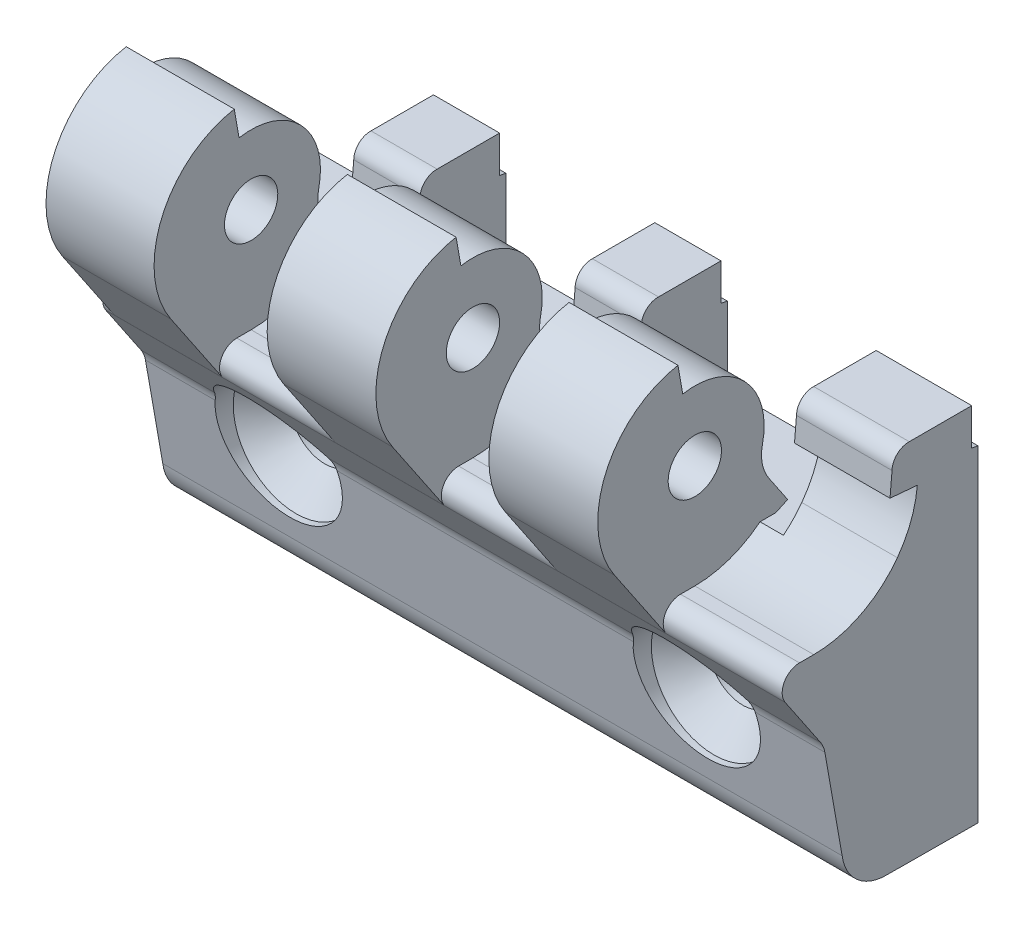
ISO-10303-21;
HEADER;
FILE_DESCRIPTION(('STEP AP214'),'2;1');
FILE_NAME('part.step','',(''),(''),'','','');
FILE_SCHEMA(('AUTOMOTIVE_DESIGN { 1 0 10303 214 1 1 1 1 }'));
ENDSEC;
DATA;
#1=APPLICATION_CONTEXT('core data for automotive mechanical design processes');
#2=APPLICATION_PROTOCOL_DEFINITION('international standard','automotive_design',2000,#1);
#3=PRODUCT_CONTEXT('',#1,'mechanical');
#4=PRODUCT('Part','Part','',(#3));
#5=PRODUCT_RELATED_PRODUCT_CATEGORY('part','',(#4));
#6=PRODUCT_DEFINITION_FORMATION('','',#4);
#7=PRODUCT_DEFINITION_CONTEXT('part definition',#1,'design');
#8=PRODUCT_DEFINITION('design','',#6,#7);
#9=PRODUCT_DEFINITION_SHAPE('','',#8);
#10=(LENGTH_UNIT() NAMED_UNIT(*) SI_UNIT(.MILLI.,.METRE.));
#11=(NAMED_UNIT(*) PLANE_ANGLE_UNIT() SI_UNIT($,.RADIAN.));
#12=(NAMED_UNIT(*) SI_UNIT($,.STERADIAN.) SOLID_ANGLE_UNIT());
#13=UNCERTAINTY_MEASURE_WITH_UNIT(LENGTH_MEASURE(1.E-05),#10,'distance_accuracy_value','');
#14=(GEOMETRIC_REPRESENTATION_CONTEXT(3) GLOBAL_UNCERTAINTY_ASSIGNED_CONTEXT((#13)) GLOBAL_UNIT_ASSIGNED_CONTEXT((#10,
#11,#12)) REPRESENTATION_CONTEXT('',''));
#15=CARTESIAN_POINT('',(0.,0.,0.));
#16=DIRECTION('',(0.,0.,1.));
#17=DIRECTION('',(1.,0.,0.));
#18=AXIS2_PLACEMENT_3D('',#15,#16,#17);
#19=CARTESIAN_POINT('',(-11.67,19.9999666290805,15.7137159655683));
#20=DIRECTION('',(-1.,0.,0.));
#21=DIRECTION('',(0.,-1.,0.));
#22=AXIS2_PLACEMENT_3D('',#19,#20,#21);
#23=CYLINDRICAL_SURFACE('',#22,2.55);
#24=CARTESIAN_POINT('',(-11.67,19.9999666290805,15.7137159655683));
#25=DIRECTION('',(-1.,0.,0.));
#26=DIRECTION('',(0.,-1.,0.));
#27=AXIS2_PLACEMENT_3D('',#24,#25,#26);
#28=CIRCLE('',#27,2.55);
#29=CARTESIAN_POINT('',(-11.67,17.4499666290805,15.7137159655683));
#30=VERTEX_POINT('',#29);
#31=EDGE_CURVE('E1467',#30,#30,#28,.T.);
#32=ORIENTED_EDGE('',*,*,#31,.T.);
#33=EDGE_LOOP('',(#32));
#34=FACE_BOUND('',#33,.T.);
#35=CARTESIAN_POINT('',(-1.33,19.9999666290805,15.7137159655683));
#36=DIRECTION('',(-1.,0.,0.));
#37=DIRECTION('',(0.,-1.,0.));
#38=AXIS2_PLACEMENT_3D('',#35,#36,#37);
#39=CIRCLE('',#38,2.55);
#40=CARTESIAN_POINT('',(-1.33,17.4499666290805,15.7137159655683));
#41=VERTEX_POINT('',#40);
#42=EDGE_CURVE('E731',#41,#41,#39,.T.);
#43=ORIENTED_EDGE('',*,*,#42,.F.);
#44=EDGE_LOOP('',(#43));
#45=FACE_BOUND('',#44,.T.);
#46=ADVANCED_FACE('F15',(#34,#45),#23,.F.);
#47=CARTESIAN_POINT('',(-11.67,17.6979546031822,5.35403256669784));
#48=DIRECTION('',(-1.,0.,0.));
#49=DIRECTION('',(0.,-1.,0.));
#50=AXIS2_PLACEMENT_3D('',#47,#48,#49);
#51=CYLINDRICAL_SURFACE('',#50,3.97949973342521);
#52=DIRECTION('',(-1.,0.,0.));
#53=VECTOR('',#52,1.);
#54=CARTESIAN_POINT('',(-11.67,15.4699793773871,8.65138673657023));
#55=LINE('',#54,#53);
#56=CARTESIAN_POINT('',(-11.67,15.4699794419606,8.65138678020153));
#57=VERTEX_POINT('',#56);
#58=CARTESIAN_POINT('',(-1.33,15.4699794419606,8.65138678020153));
#59=VERTEX_POINT('',#58);
#60=EDGE_CURVE('E484',#57,#59,#55,.F.);
#61=ORIENTED_EDGE('',*,*,#60,.F.);
#62=CARTESIAN_POINT('',(-11.67,17.6979546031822,5.35403256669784));
#63=DIRECTION('',(-1.,0.,0.));
#64=DIRECTION('',(0.,-1.,0.));
#65=AXIS2_PLACEMENT_3D('',#62,#63,#64);
#66=CIRCLE('',#65,3.97949973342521);
#67=CARTESIAN_POINT('',(-11.67,18.5614666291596,9.23871596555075));
#68=VERTEX_POINT('',#67);
#69=EDGE_CURVE('E18',#57,#68,#66,.T.);
#70=ORIENTED_EDGE('',*,*,#69,.T.);
#71=DIRECTION('',(-1.,0.,0.));
#72=VECTOR('',#71,1.);
#73=CARTESIAN_POINT('',(-11.67,18.5614666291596,9.23871596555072));
#74=LINE('',#73,#72);
#75=CARTESIAN_POINT('',(-1.33,18.5614666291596,9.23871596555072));
#76=VERTEX_POINT('',#75);
#77=EDGE_CURVE('E1100',#76,#68,#74,.T.);
#78=ORIENTED_EDGE('',*,*,#77,.F.);
#79=CARTESIAN_POINT('',(-1.33,17.6979546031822,5.35403256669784));
#80=DIRECTION('',(-1.,0.,0.));
#81=DIRECTION('',(0.,-1.,0.));
#82=AXIS2_PLACEMENT_3D('',#79,#80,#81);
#83=CIRCLE('',#82,3.97949973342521);
#84=EDGE_CURVE('E487',#59,#76,#83,.T.);
#85=ORIENTED_EDGE('',*,*,#84,.F.);
#86=EDGE_LOOP('',(#61,#70,#78,#85));
#87=FACE_BOUND('',#86,.T.);
#88=ADVANCED_FACE('F485',(#87),#51,.F.);
#89=CARTESIAN_POINT('',(-11.67,20.0002680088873,15.7132743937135));
#90=DIRECTION('',(-1.,0.,0.));
#91=DIRECTION('',(0.,-1.,0.));
#92=AXIS2_PLACEMENT_3D('',#89,#90,#91);
#93=CYLINDRICAL_SURFACE('',#92,6.6325);
#94=CARTESIAN_POINT('',(-11.67,20.0002680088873,15.7132743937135));
#95=DIRECTION('',(-1.,0.,0.));
#96=DIRECTION('',(0.,-1.,0.));
#97=AXIS2_PLACEMENT_3D('',#94,#95,#96);
#98=CIRCLE('',#97,6.6325);
#99=CARTESIAN_POINT('',(-11.67,26.5319666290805,16.8652159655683));
#100=VERTEX_POINT('',#99);
#101=EDGE_CURVE('E479',#68,#100,#98,.F.);
#102=ORIENTED_EDGE('',*,*,#101,.T.);
#103=DIRECTION('',(-1.,0.,0.));
#104=VECTOR('',#103,1.);
#105=CARTESIAN_POINT('',(-11.67,26.5319666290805,16.8652159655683));
#106=LINE('',#105,#104);
#107=CARTESIAN_POINT('',(-1.33,26.5319666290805,16.8652159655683));
#108=VERTEX_POINT('',#107);
#109=EDGE_CURVE('E1097',#108,#100,#106,.T.);
#110=ORIENTED_EDGE('',*,*,#109,.F.);
#111=CARTESIAN_POINT('',(-1.33,20.0002680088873,15.7132743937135));
#112=DIRECTION('',(-1.,0.,0.));
#113=DIRECTION('',(0.,-1.,0.));
#114=AXIS2_PLACEMENT_3D('',#111,#112,#113);
#115=CIRCLE('',#114,6.6325);
#116=EDGE_CURVE('E726',#76,#108,#115,.F.);
#117=ORIENTED_EDGE('',*,*,#116,.F.);
#118=ORIENTED_EDGE('',*,*,#77,.T.);
#119=EDGE_LOOP('',(#102,#110,#117,#118));
#120=FACE_BOUND('',#119,.T.);
#121=ADVANCED_FACE('F1683',(#120),#93,.T.);
#122=CARTESIAN_POINT('',(-11.67,29.1444666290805,17.3262159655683));
#123=DIRECTION('',(0.,0.17377458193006,-0.98478545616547));
#124=DIRECTION('',(0.,-0.98478545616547,-0.17377458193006));
#125=AXIS2_PLACEMENT_3D('',#122,#123,#124);
#126=PLANE('',#125);
#127=DIRECTION('',(0.,0.98478545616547,0.17377458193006));
#128=VECTOR('',#127,1.);
#129=CARTESIAN_POINT('',(-11.67,26.5319666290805,16.8652159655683));
#130=LINE('',#129,#128);
#131=CARTESIAN_POINT('',(-11.67,29.1444666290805,17.3262159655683));
#132=VERTEX_POINT('',#131);
#133=EDGE_CURVE('E1469',#100,#132,#130,.T.);
#134=ORIENTED_EDGE('',*,*,#133,.T.);
#135=DIRECTION('',(-1.,0.,0.));
#136=VECTOR('',#135,1.);
#137=CARTESIAN_POINT('',(-11.67,29.1444666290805,17.3262159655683));
#138=LINE('',#137,#136);
#139=CARTESIAN_POINT('',(-1.33,29.1444666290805,17.3262159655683));
#140=VERTEX_POINT('',#139);
#141=EDGE_CURVE('E1093',#140,#132,#138,.T.);
#142=ORIENTED_EDGE('',*,*,#141,.F.);
#143=DIRECTION('',(0.,0.98478545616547,0.17377458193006));
#144=VECTOR('',#143,1.);
#145=CARTESIAN_POINT('',(-1.33,26.5319666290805,16.8652159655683));
#146=LINE('',#145,#144);
#147=EDGE_CURVE('E725',#108,#140,#146,.T.);
#148=ORIENTED_EDGE('',*,*,#147,.F.);
#149=ORIENTED_EDGE('',*,*,#109,.T.);
#150=EDGE_LOOP('',(#134,#142,#148,#149));
#151=FACE_BOUND('',#150,.T.);
#152=ADVANCED_FACE('F1687',(#151),#126,.T.);
#153=CARTESIAN_POINT('',(-11.67,20.0000000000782,15.7140000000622));
#154=DIRECTION('',(-1.,0.,0.));
#155=DIRECTION('',(0.,-1.,0.));
#156=AXIS2_PLACEMENT_3D('',#153,#154,#155);
#157=CYLINDRICAL_SURFACE('',#156,9.28549999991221);
#158=CARTESIAN_POINT('',(-11.67,20.0000000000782,15.7140000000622));
#159=DIRECTION('',(-1.,0.,0.));
#160=DIRECTION('',(0.,-1.,0.));
#161=AXIS2_PLACEMENT_3D('',#158,#159,#160);
#162=CIRCLE('',#161,9.28549999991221);
#163=CARTESIAN_POINT('',(-11.67,14.8019985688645,23.4082375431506));
#164=VERTEX_POINT('',#163);
#165=EDGE_CURVE('E1468',#132,#164,#162,.F.);
#166=ORIENTED_EDGE('',*,*,#165,.T.);
#167=DIRECTION('',(-1.,0.,0.));
#168=VECTOR('',#167,1.);
#169=CARTESIAN_POINT('',(-11.67,14.8019985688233,23.4082375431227));
#170=LINE('',#169,#168);
#171=CARTESIAN_POINT('',(-1.33,14.8019985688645,23.4082375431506));
#172=VERTEX_POINT('',#171);
#173=EDGE_CURVE('E1089',#172,#164,#170,.T.);
#174=ORIENTED_EDGE('',*,*,#173,.F.);
#175=CARTESIAN_POINT('',(-1.33,20.0000000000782,15.7140000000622));
#176=DIRECTION('',(-1.,0.,0.));
#177=DIRECTION('',(0.,-1.,0.));
#178=AXIS2_PLACEMENT_3D('',#175,#176,#177);
#179=CIRCLE('',#178,9.28549999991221);
#180=EDGE_CURVE('E721',#140,#172,#179,.F.);
#181=ORIENTED_EDGE('',*,*,#180,.F.);
#182=ORIENTED_EDGE('',*,*,#141,.T.);
#183=EDGE_LOOP('',(#166,#174,#181,#182));
#184=FACE_BOUND('',#183,.T.);
#185=ADVANCED_FACE('F1689',(#184),#157,.T.);
#186=CARTESIAN_POINT('',(19.89,19.9999666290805,15.7137159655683));
#187=DIRECTION('',(1.,0.,0.));
#188=DIRECTION('',(0.,1.,0.));
#189=AXIS2_PLACEMENT_3D('',#186,#187,#188);
#190=CYLINDRICAL_SURFACE('',#189,2.55);
#191=CARTESIAN_POINT('',(9.49,19.9999666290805,15.7137159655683));
#192=DIRECTION('',(1.,0.,0.));
#193=DIRECTION('',(0.,1.,0.));
#194=AXIS2_PLACEMENT_3D('',#191,#192,#193);
#195=CIRCLE('',#194,2.55);
#196=CARTESIAN_POINT('',(9.49,22.5499666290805,15.7137159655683));
#197=VERTEX_POINT('',#196);
#198=EDGE_CURVE('E736',#197,#197,#195,.F.);
#199=ORIENTED_EDGE('',*,*,#198,.T.);
#200=EDGE_LOOP('',(#199));
#201=FACE_BOUND('',#200,.T.);
#202=CARTESIAN_POINT('',(19.89,19.9999666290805,15.7137159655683));
#203=DIRECTION('',(1.,0.,0.));
#204=DIRECTION('',(0.,1.,0.));
#205=AXIS2_PLACEMENT_3D('',#202,#203,#204);
#206=CIRCLE('',#205,2.55);
#207=CARTESIAN_POINT('',(19.89,22.5499666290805,15.7137159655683));
#208=VERTEX_POINT('',#207);
#209=EDGE_CURVE('E704',#208,#208,#206,.F.);
#210=ORIENTED_EDGE('',*,*,#209,.F.);
#211=EDGE_LOOP('',(#210));
#212=FACE_BOUND('',#211,.T.);
#213=ADVANCED_FACE('F1691',(#201,#212),#190,.F.);
#214=CARTESIAN_POINT('',(19.89,17.6979546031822,5.35403256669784));
#215=DIRECTION('',(1.,0.,0.));
#216=DIRECTION('',(0.,1.,0.));
#217=AXIS2_PLACEMENT_3D('',#214,#215,#216);
#218=CYLINDRICAL_SURFACE('',#217,3.97949973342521);
#219=DIRECTION('',(1.,0.,0.));
#220=VECTOR('',#219,1.);
#221=CARTESIAN_POINT('',(19.89,18.5614666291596,9.23871596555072));
#222=LINE('',#221,#220);
#223=CARTESIAN_POINT('',(19.89,18.5614666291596,9.23871596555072));
#224=VERTEX_POINT('',#223);
#225=CARTESIAN_POINT('',(9.49,18.5614666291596,9.23871596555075));
#226=VERTEX_POINT('',#225);
#227=EDGE_CURVE('E1096',#224,#226,#222,.F.);
#228=ORIENTED_EDGE('',*,*,#227,.F.);
#229=CARTESIAN_POINT('',(19.89,17.6979546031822,5.35403256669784));
#230=DIRECTION('',(1.,0.,0.));
#231=DIRECTION('',(0.,1.,0.));
#232=AXIS2_PLACEMENT_3D('',#229,#230,#231);
#233=CIRCLE('',#232,3.97949973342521);
#234=CARTESIAN_POINT('',(19.89,15.4699794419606,8.65138678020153));
#235=VERTEX_POINT('',#234);
#236=EDGE_CURVE('E700',#235,#224,#233,.F.);
#237=ORIENTED_EDGE('',*,*,#236,.F.);
#238=DIRECTION('',(-1.,0.,0.));
#239=VECTOR('',#238,1.);
#240=CARTESIAN_POINT('',(19.89,15.4699793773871,8.65138673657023));
#241=LINE('',#240,#239);
#242=CARTESIAN_POINT('',(9.49,15.4699794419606,8.65138678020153));
#243=VERTEX_POINT('',#242);
#244=EDGE_CURVE('E490',#243,#235,#241,.F.);
#245=ORIENTED_EDGE('',*,*,#244,.F.);
#246=CARTESIAN_POINT('',(9.49,17.6979546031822,5.35403256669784));
#247=DIRECTION('',(1.,0.,0.));
#248=DIRECTION('',(0.,1.,0.));
#249=AXIS2_PLACEMENT_3D('',#246,#247,#248);
#250=CIRCLE('',#249,3.97949973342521);
#251=EDGE_CURVE('E745',#243,#226,#250,.F.);
#252=ORIENTED_EDGE('',*,*,#251,.T.);
#253=EDGE_LOOP('',(#228,#237,#245,#252));
#254=FACE_BOUND('',#253,.T.);
#255=ADVANCED_FACE('F1532',(#254),#218,.F.);
#256=CARTESIAN_POINT('',(19.89,20.0002680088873,15.7132743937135));
#257=DIRECTION('',(1.,0.,0.));
#258=DIRECTION('',(0.,1.,0.));
#259=AXIS2_PLACEMENT_3D('',#256,#257,#258);
#260=CYLINDRICAL_SURFACE('',#259,6.6325);
#261=CARTESIAN_POINT('',(19.89,20.0002680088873,15.7132743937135));
#262=DIRECTION('',(1.,0.,0.));
#263=DIRECTION('',(0.,1.,0.));
#264=AXIS2_PLACEMENT_3D('',#261,#262,#263);
#265=CIRCLE('',#264,6.6325);
#266=CARTESIAN_POINT('',(19.89,26.5319666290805,16.8652159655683));
#267=VERTEX_POINT('',#266);
#268=EDGE_CURVE('E697',#224,#267,#265,.T.);
#269=ORIENTED_EDGE('',*,*,#268,.F.);
#270=ORIENTED_EDGE('',*,*,#227,.T.);
#271=CARTESIAN_POINT('',(9.49,20.0002680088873,15.7132743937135));
#272=DIRECTION('',(1.,0.,0.));
#273=DIRECTION('',(0.,1.,0.));
#274=AXIS2_PLACEMENT_3D('',#271,#272,#273);
#275=CIRCLE('',#274,6.6325);
#276=CARTESIAN_POINT('',(9.49,26.5319666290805,16.8652159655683));
#277=VERTEX_POINT('',#276);
#278=EDGE_CURVE('E743',#226,#277,#275,.T.);
#279=ORIENTED_EDGE('',*,*,#278,.T.);
#280=DIRECTION('',(-1.,0.,0.));
#281=VECTOR('',#280,1.);
#282=CARTESIAN_POINT('',(19.89,26.5319666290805,16.8652159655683));
#283=LINE('',#282,#281);
#284=EDGE_CURVE('E1510',#267,#277,#283,.T.);
#285=ORIENTED_EDGE('',*,*,#284,.F.);
#286=EDGE_LOOP('',(#269,#270,#279,#285));
#287=FACE_BOUND('',#286,.T.);
#288=ADVANCED_FACE('F1518',(#287),#260,.T.);
#289=CARTESIAN_POINT('',(19.89,26.5319666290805,16.8652159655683));
#290=DIRECTION('',(0.,0.17377458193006,-0.98478545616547));
#291=DIRECTION('',(0.,-0.98478545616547,-0.17377458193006));
#292=AXIS2_PLACEMENT_3D('',#289,#290,#291);
#293=PLANE('',#292);
#294=DIRECTION('',(0.,0.98478545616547,0.17377458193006));
#295=VECTOR('',#294,1.);
#296=CARTESIAN_POINT('',(19.89,26.5319666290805,16.8652159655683));
#297=LINE('',#296,#295);
#298=CARTESIAN_POINT('',(19.89,29.1444666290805,17.3262159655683));
#299=VERTEX_POINT('',#298);
#300=EDGE_CURVE('E696',#267,#299,#297,.T.);
#301=ORIENTED_EDGE('',*,*,#300,.F.);
#302=ORIENTED_EDGE('',*,*,#284,.T.);
#303=DIRECTION('',(0.,0.98478545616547,0.17377458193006));
#304=VECTOR('',#303,1.);
#305=CARTESIAN_POINT('',(9.49,26.5319666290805,16.8652159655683));
#306=LINE('',#305,#304);
#307=CARTESIAN_POINT('',(9.49,29.1444666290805,17.3262159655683));
#308=VERTEX_POINT('',#307);
#309=EDGE_CURVE('E742',#277,#308,#306,.T.);
#310=ORIENTED_EDGE('',*,*,#309,.T.);
#311=DIRECTION('',(1.,0.,0.));
#312=VECTOR('',#311,1.);
#313=CARTESIAN_POINT('',(19.89,29.1444666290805,17.3262159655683));
#314=LINE('',#313,#312);
#315=EDGE_CURVE('E1492',#299,#308,#314,.F.);
#316=ORIENTED_EDGE('',*,*,#315,.F.);
#317=EDGE_LOOP('',(#301,#302,#310,#316));
#318=FACE_BOUND('',#317,.T.);
#319=ADVANCED_FACE('F1527',(#318),#293,.T.);
#320=CARTESIAN_POINT('',(19.89,20.0000000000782,15.7140000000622));
#321=DIRECTION('',(1.,0.,0.));
#322=DIRECTION('',(0.,1.,0.));
#323=AXIS2_PLACEMENT_3D('',#320,#321,#322);
#324=CYLINDRICAL_SURFACE('',#323,9.28549999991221);
#325=CARTESIAN_POINT('',(19.89,20.0000000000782,15.7140000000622));
#326=DIRECTION('',(1.,0.,0.));
#327=DIRECTION('',(0.,1.,0.));
#328=AXIS2_PLACEMENT_3D('',#325,#326,#327);
#329=CIRCLE('',#328,9.28549999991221);
#330=CARTESIAN_POINT('',(19.89,14.8019985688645,23.4082375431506));
#331=VERTEX_POINT('',#330);
#332=EDGE_CURVE('E692',#299,#331,#329,.T.);
#333=ORIENTED_EDGE('',*,*,#332,.F.);
#334=ORIENTED_EDGE('',*,*,#315,.T.);
#335=CARTESIAN_POINT('',(9.49,20.0000000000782,15.7140000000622));
#336=DIRECTION('',(1.,0.,0.));
#337=DIRECTION('',(0.,1.,0.));
#338=AXIS2_PLACEMENT_3D('',#335,#336,#337);
#339=CIRCLE('',#338,9.28549999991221);
#340=CARTESIAN_POINT('',(9.49,14.8019985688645,23.4082375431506));
#341=VERTEX_POINT('',#340);
#342=EDGE_CURVE('E740',#308,#341,#339,.T.);
#343=ORIENTED_EDGE('',*,*,#342,.T.);
#344=DIRECTION('',(-1.,0.,0.));
#345=VECTOR('',#344,1.);
#346=CARTESIAN_POINT('',(19.89,14.8019985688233,23.4082375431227));
#347=LINE('',#346,#345);
#348=EDGE_CURVE('E1483',#331,#341,#347,.T.);
#349=ORIENTED_EDGE('',*,*,#348,.F.);
#350=EDGE_LOOP('',(#333,#334,#343,#349));
#351=FACE_BOUND('',#350,.T.);
#352=ADVANCED_FACE('F1530',(#351),#324,.T.);
#353=CARTESIAN_POINT('',(41.12,19.9999666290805,15.7137159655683));
#354=DIRECTION('',(1.,0.,0.));
#355=DIRECTION('',(0.,1.,0.));
#356=AXIS2_PLACEMENT_3D('',#353,#354,#355);
#357=CYLINDRICAL_SURFACE('',#356,2.55);
#358=CARTESIAN_POINT('',(30.7,19.9999666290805,15.7137159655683));
#359=DIRECTION('',(1.,0.,0.));
#360=DIRECTION('',(0.,1.,0.));
#361=AXIS2_PLACEMENT_3D('',#358,#359,#360);
#362=CIRCLE('',#361,2.55);
#363=CARTESIAN_POINT('',(30.7,22.5499666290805,15.7137159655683));
#364=VERTEX_POINT('',#363);
#365=EDGE_CURVE('E709',#364,#364,#362,.F.);
#366=ORIENTED_EDGE('',*,*,#365,.T.);
#367=EDGE_LOOP('',(#366));
#368=FACE_BOUND('',#367,.T.);
#369=CARTESIAN_POINT('',(41.12,19.9999666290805,15.7137159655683));
#370=DIRECTION('',(1.,0.,0.));
#371=DIRECTION('',(0.,1.,0.));
#372=AXIS2_PLACEMENT_3D('',#369,#370,#371);
#373=CIRCLE('',#372,2.55);
#374=CARTESIAN_POINT('',(41.12,22.5499666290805,15.7137159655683));
#375=VERTEX_POINT('',#374);
#376=EDGE_CURVE('E687',#375,#375,#373,.F.);
#377=ORIENTED_EDGE('',*,*,#376,.F.);
#378=EDGE_LOOP('',(#377));
#379=FACE_BOUND('',#378,.T.);
#380=ADVANCED_FACE('F1745',(#368,#379),#357,.F.);
#381=CARTESIAN_POINT('',(41.12,17.6979546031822,5.35403256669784));
#382=DIRECTION('',(1.,0.,0.));
#383=DIRECTION('',(0.,1.,0.));
#384=AXIS2_PLACEMENT_3D('',#381,#382,#383);
#385=CYLINDRICAL_SURFACE('',#384,3.97949973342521);
#386=DIRECTION('',(1.,0.,0.));
#387=VECTOR('',#386,1.);
#388=CARTESIAN_POINT('',(41.12,18.5614666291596,9.23871596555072));
#389=LINE('',#388,#387);
#390=CARTESIAN_POINT('',(41.12,18.5614666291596,9.23871596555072));
#391=VERTEX_POINT('',#390);
#392=CARTESIAN_POINT('',(30.7,18.5614666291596,9.23871596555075));
#393=VERTEX_POINT('',#392);
#394=EDGE_CURVE('E1489',#391,#393,#389,.F.);
#395=ORIENTED_EDGE('',*,*,#394,.F.);
#396=CARTESIAN_POINT('',(41.12,17.6979546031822,5.35403256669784));
#397=DIRECTION('',(1.,0.,0.));
#398=DIRECTION('',(0.,1.,0.));
#399=AXIS2_PLACEMENT_3D('',#396,#397,#398);
#400=CIRCLE('',#399,3.97949973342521);
#401=CARTESIAN_POINT('',(41.12,15.4699794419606,8.65138678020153));
#402=VERTEX_POINT('',#401);
#403=EDGE_CURVE('E683',#402,#391,#400,.F.);
#404=ORIENTED_EDGE('',*,*,#403,.F.);
#405=DIRECTION('',(-1.,0.,0.));
#406=VECTOR('',#405,1.);
#407=CARTESIAN_POINT('',(41.12,15.4699793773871,8.65138673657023));
#408=LINE('',#407,#406);
#409=CARTESIAN_POINT('',(30.7,15.4699794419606,8.65138678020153));
#410=VERTEX_POINT('',#409);
#411=EDGE_CURVE('E1428',#410,#402,#408,.F.);
#412=ORIENTED_EDGE('',*,*,#411,.F.);
#413=CARTESIAN_POINT('',(30.7,17.6979546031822,5.35403256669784));
#414=DIRECTION('',(1.,0.,0.));
#415=DIRECTION('',(0.,1.,0.));
#416=AXIS2_PLACEMENT_3D('',#413,#414,#415);
#417=CIRCLE('',#416,3.97949973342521);
#418=EDGE_CURVE('E718',#410,#393,#417,.F.);
#419=ORIENTED_EDGE('',*,*,#418,.T.);
#420=EDGE_LOOP('',(#395,#404,#412,#419));
#421=FACE_BOUND('',#420,.T.);
#422=ADVANCED_FACE('F1741',(#421),#385,.F.);
#423=CARTESIAN_POINT('',(41.12,20.0002680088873,15.7132743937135));
#424=DIRECTION('',(1.,0.,0.));
#425=DIRECTION('',(0.,1.,0.));
#426=AXIS2_PLACEMENT_3D('',#423,#424,#425);
#427=CYLINDRICAL_SURFACE('',#426,6.6325);
#428=CARTESIAN_POINT('',(41.12,20.0002680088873,15.7132743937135));
#429=DIRECTION('',(1.,0.,0.));
#430=DIRECTION('',(0.,1.,0.));
#431=AXIS2_PLACEMENT_3D('',#428,#429,#430);
#432=CIRCLE('',#431,6.6325);
#433=CARTESIAN_POINT('',(41.12,26.5319666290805,16.8652159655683));
#434=VERTEX_POINT('',#433);
#435=EDGE_CURVE('E680',#391,#434,#432,.T.);
#436=ORIENTED_EDGE('',*,*,#435,.F.);
#437=ORIENTED_EDGE('',*,*,#394,.T.);
#438=CARTESIAN_POINT('',(30.7,20.0002680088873,15.7132743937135));
#439=DIRECTION('',(1.,0.,0.));
#440=DIRECTION('',(0.,1.,0.));
#441=AXIS2_PLACEMENT_3D('',#438,#439,#440);
#442=CIRCLE('',#441,6.6325);
#443=CARTESIAN_POINT('',(30.7,26.5319666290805,16.8652159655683));
#444=VERTEX_POINT('',#443);
#445=EDGE_CURVE('E716',#393,#444,#442,.T.);
#446=ORIENTED_EDGE('',*,*,#445,.T.);
#447=DIRECTION('',(-1.,0.,0.));
#448=VECTOR('',#447,1.);
#449=CARTESIAN_POINT('',(41.12,26.5319666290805,16.8652159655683));
#450=LINE('',#449,#448);
#451=EDGE_CURVE('E1486',#434,#444,#450,.T.);
#452=ORIENTED_EDGE('',*,*,#451,.F.);
#453=EDGE_LOOP('',(#436,#437,#446,#452));
#454=FACE_BOUND('',#453,.T.);
#455=ADVANCED_FACE('F1737',(#454),#427,.T.);
#456=CARTESIAN_POINT('',(41.12,26.5319666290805,16.8652159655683));
#457=DIRECTION('',(0.,0.17377458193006,-0.98478545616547));
#458=DIRECTION('',(0.,-0.98478545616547,-0.17377458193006));
#459=AXIS2_PLACEMENT_3D('',#456,#457,#458);
#460=PLANE('',#459);
#461=DIRECTION('',(0.,0.98478545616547,0.17377458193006));
#462=VECTOR('',#461,1.);
#463=CARTESIAN_POINT('',(41.12,26.5319666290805,16.8652159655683));
#464=LINE('',#463,#462);
#465=CARTESIAN_POINT('',(41.12,29.1444666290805,17.3262159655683));
#466=VERTEX_POINT('',#465);
#467=EDGE_CURVE('E679',#434,#466,#464,.T.);
#468=ORIENTED_EDGE('',*,*,#467,.F.);
#469=ORIENTED_EDGE('',*,*,#451,.T.);
#470=DIRECTION('',(0.,0.98478545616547,0.17377458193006));
#471=VECTOR('',#470,1.);
#472=CARTESIAN_POINT('',(30.7,26.5319666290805,16.8652159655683));
#473=LINE('',#472,#471);
#474=CARTESIAN_POINT('',(30.7,29.1444666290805,17.3262159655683));
#475=VERTEX_POINT('',#474);
#476=EDGE_CURVE('E715',#444,#475,#473,.T.);
#477=ORIENTED_EDGE('',*,*,#476,.T.);
#478=DIRECTION('',(1.,0.,0.));
#479=VECTOR('',#478,1.);
#480=CARTESIAN_POINT('',(41.12,29.1444666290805,17.3262159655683));
#481=LINE('',#480,#479);
#482=EDGE_CURVE('E1092',#466,#475,#481,.F.);
#483=ORIENTED_EDGE('',*,*,#482,.F.);
#484=EDGE_LOOP('',(#468,#469,#477,#483));
#485=FACE_BOUND('',#484,.T.);
#486=ADVANCED_FACE('F1733',(#485),#460,.T.);
#487=CARTESIAN_POINT('',(41.12,20.0000000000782,15.7140000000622));
#488=DIRECTION('',(1.,0.,0.));
#489=DIRECTION('',(0.,1.,0.));
#490=AXIS2_PLACEMENT_3D('',#487,#488,#489);
#491=CYLINDRICAL_SURFACE('',#490,9.28549999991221);
#492=CARTESIAN_POINT('',(41.12,20.0000000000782,15.7140000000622));
#493=DIRECTION('',(1.,0.,0.));
#494=DIRECTION('',(0.,1.,0.));
#495=AXIS2_PLACEMENT_3D('',#492,#493,#494);
#496=CIRCLE('',#495,9.28549999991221);
#497=CARTESIAN_POINT('',(41.12,14.8019985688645,23.4082375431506));
#498=VERTEX_POINT('',#497);
#499=EDGE_CURVE('E675',#466,#498,#496,.T.);
#500=ORIENTED_EDGE('',*,*,#499,.F.);
#501=ORIENTED_EDGE('',*,*,#482,.T.);
#502=CARTESIAN_POINT('',(30.7,20.0000000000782,15.7140000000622));
#503=DIRECTION('',(1.,0.,0.));
#504=DIRECTION('',(0.,1.,0.));
#505=AXIS2_PLACEMENT_3D('',#502,#503,#504);
#506=CIRCLE('',#505,9.28549999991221);
#507=CARTESIAN_POINT('',(30.7,14.8019985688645,23.4082375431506));
#508=VERTEX_POINT('',#507);
#509=EDGE_CURVE('E713',#475,#508,#506,.T.);
#510=ORIENTED_EDGE('',*,*,#509,.T.);
#511=DIRECTION('',(-1.,0.,0.));
#512=VECTOR('',#511,1.);
#513=CARTESIAN_POINT('',(41.12,14.8019985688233,23.4082375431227));
#514=LINE('',#513,#512);
#515=EDGE_CURVE('E1480',#498,#508,#514,.T.);
#516=ORIENTED_EDGE('',*,*,#515,.F.);
#517=EDGE_LOOP('',(#500,#501,#510,#516));
#518=FACE_BOUND('',#517,.T.);
#519=ADVANCED_FACE('F1728',(#518),#491,.T.);
#520=CARTESIAN_POINT('',(-11.67,7.4644666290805,18.4512159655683));
#521=DIRECTION('',(0.,-0.559797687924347,0.828629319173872));
#522=DIRECTION('',(0.,0.828629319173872,0.559797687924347));
#523=AXIS2_PLACEMENT_3D('',#520,#521,#522);
#524=PLANE('',#523);
#525=ORIENTED_EDGE('',*,*,#173,.T.);
#526=DIRECTION('',(0.,-0.82862931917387,-0.559797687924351));
#527=VECTOR('',#526,1.);
#528=CARTESIAN_POINT('',(-11.67,14.8019985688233,23.4082375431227));
#529=LINE('',#528,#527);
#530=CARTESIAN_POINT('',(-11.67,7.48718669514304,18.4665649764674));
#531=VERTEX_POINT('',#530);
#532=EDGE_CURVE('E1465',#164,#531,#529,.T.);
#533=ORIENTED_EDGE('',*,*,#532,.T.);
#534=DIRECTION('',(1.,0.,0.));
#535=VECTOR('',#534,1.);
#536=CARTESIAN_POINT('',(52.5,7.4871866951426,18.4665649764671));
#537=LINE('',#536,#535);
#538=CARTESIAN_POINT('',(-1.33,7.48718669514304,18.4665649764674));
#539=VERTEX_POINT('',#538);
#540=EDGE_CURVE('E666',#539,#531,#537,.F.);
#541=ORIENTED_EDGE('',*,*,#540,.F.);
#542=DIRECTION('',(0.,-0.82862931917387,-0.559797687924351));
#543=VECTOR('',#542,1.);
#544=CARTESIAN_POINT('',(-1.33,14.8019985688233,23.4082375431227));
#545=LINE('',#544,#543);
#546=EDGE_CURVE('E724',#172,#539,#545,.T.);
#547=ORIENTED_EDGE('',*,*,#546,.F.);
#548=EDGE_LOOP('',(#525,#533,#541,#547));
#549=FACE_BOUND('',#548,.T.);
#550=ADVANCED_FACE('F1678',(#549),#524,.T.);
#551=CARTESIAN_POINT('',(-11.67,20.,0.));
#552=DIRECTION('',(1.,0.,0.));
#553=DIRECTION('',(0.,1.,0.));
#554=AXIS2_PLACEMENT_3D('',#551,#552,#553);
#555=PLANE('',#554);
#556=ORIENTED_EDGE('',*,*,#31,.F.);
#557=EDGE_LOOP('',(#556));
#558=FACE_BOUND('',#557,.T.);
#559=ORIENTED_EDGE('',*,*,#532,.F.);
#560=ORIENTED_EDGE('',*,*,#165,.F.);
#561=ORIENTED_EDGE('',*,*,#133,.F.);
#562=ORIENTED_EDGE('',*,*,#101,.F.);
#563=ORIENTED_EDGE('',*,*,#69,.F.);
#564=DIRECTION('',(0.,-0.828585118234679,-0.55986310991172));
#565=VECTOR('',#564,1.);
#566=CARTESIAN_POINT('',(-11.67,15.4699793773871,8.65138673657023));
#567=LINE('',#566,#565);
#568=CARTESIAN_POINT('',(-11.67,12.7724666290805,6.82871596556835));
#569=VERTEX_POINT('',#568);
#570=EDGE_CURVE('E476',#569,#57,#567,.F.);
#571=ORIENTED_EDGE('',*,*,#570,.F.);
#572=DIRECTION('',(0.,0.415426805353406,-0.909626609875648));
#573=VECTOR('',#572,1.);
#574=CARTESIAN_POINT('',(-11.67,12.25,7.97271905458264));
#575=LINE('',#574,#573);
#576=CARTESIAN_POINT('',(-11.67,12.25,7.97271905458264));
#577=VERTEX_POINT('',#576);
#578=EDGE_CURVE('E482',#577,#569,#575,.T.);
#579=ORIENTED_EDGE('',*,*,#578,.F.);
#580=DIRECTION('',(0.,0.,1.));
#581=VECTOR('',#580,1.);
#582=CARTESIAN_POINT('',(-11.67,12.25,0.));
#583=LINE('',#582,#581);
#584=CARTESIAN_POINT('',(-11.67,12.25,9.47537381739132));
#585=VERTEX_POINT('',#584);
#586=EDGE_CURVE('E506',#585,#577,#583,.F.);
#587=ORIENTED_EDGE('',*,*,#586,.F.);
#588=CARTESIAN_POINT('',(-11.67,19.9999999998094,15.7139714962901));
#589=DIRECTION('',(1.,0.,0.));
#590=DIRECTION('',(0.,1.,0.));
#591=AXIS2_PLACEMENT_3D('',#588,#589,#590);
#592=CIRCLE('',#591,9.94899999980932);
#593=CARTESIAN_POINT('',(-11.67,10.051,15.7139714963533));
#594=VERTEX_POINT('',#593);
#595=EDGE_CURVE('E671',#585,#594,#592,.F.);
#596=ORIENTED_EDGE('',*,*,#595,.T.);
#597=DIRECTION('',(0.,0.,1.));
#598=VECTOR('',#597,1.);
#599=CARTESIAN_POINT('',(-11.67,10.051,15.7139714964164));
#600=LINE('',#599,#598);
#601=CARTESIAN_POINT('',(-11.67,10.051,17.0778728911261));
#602=VERTEX_POINT('',#601);
#603=EDGE_CURVE('E673',#602,#594,#600,.F.);
#604=ORIENTED_EDGE('',*,*,#603,.F.);
#605=CARTESIAN_POINT('',(-11.67,8.3930001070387,17.0778728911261));
#606=DIRECTION('',(1.,0.,0.));
#607=DIRECTION('',(0.,1.,0.));
#608=AXIS2_PLACEMENT_3D('',#605,#606,#607);
#609=CIRCLE('',#608,1.65799989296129);
#610=EDGE_CURVE('E662',#531,#602,#609,.F.);
#611=ORIENTED_EDGE('',*,*,#610,.F.);
#612=EDGE_LOOP('',(#559,#560,#561,#562,#563,#571,#579,#587,#596,#604,#611));
#613=FACE_BOUND('',#612,.T.);
#614=ADVANCED_FACE('F473',(#558,#613),#555,.F.);
#615=CARTESIAN_POINT('',(41.12,14.8019985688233,23.4082375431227));
#616=DIRECTION('',(0.,-0.559797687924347,0.828629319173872));
#617=DIRECTION('',(0.,0.828629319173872,0.559797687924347));
#618=AXIS2_PLACEMENT_3D('',#615,#616,#617);
#619=PLANE('',#618);
#620=ORIENTED_EDGE('',*,*,#515,.T.);
#621=DIRECTION('',(0.,-0.82862931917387,-0.559797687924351));
#622=VECTOR('',#621,1.);
#623=CARTESIAN_POINT('',(30.7,14.8019985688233,23.4082375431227));
#624=LINE('',#623,#622);
#625=CARTESIAN_POINT('',(30.7,7.48718669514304,18.4665649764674));
#626=VERTEX_POINT('',#625);
#627=EDGE_CURVE('E712',#508,#626,#624,.T.);
#628=ORIENTED_EDGE('',*,*,#627,.T.);
#629=DIRECTION('',(1.,0.,0.));
#630=VECTOR('',#629,1.);
#631=CARTESIAN_POINT('',(52.5,7.4871866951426,18.4665649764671));
#632=LINE('',#631,#630);
#633=CARTESIAN_POINT('',(41.12,7.48718669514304,18.4665649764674));
#634=VERTEX_POINT('',#633);
#635=EDGE_CURVE('E657',#634,#626,#632,.F.);
#636=ORIENTED_EDGE('',*,*,#635,.F.);
#637=DIRECTION('',(0.,-0.82862931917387,-0.559797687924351));
#638=VECTOR('',#637,1.);
#639=CARTESIAN_POINT('',(41.12,14.8019985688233,23.4082375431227));
#640=LINE('',#639,#638);
#641=EDGE_CURVE('E678',#498,#634,#640,.T.);
#642=ORIENTED_EDGE('',*,*,#641,.F.);
#643=EDGE_LOOP('',(#620,#628,#636,#642));
#644=FACE_BOUND('',#643,.T.);
#645=ADVANCED_FACE('F1719',(#644),#619,.T.);
#646=CARTESIAN_POINT('',(19.89,14.8019985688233,23.4082375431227));
#647=DIRECTION('',(0.,-0.559797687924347,0.828629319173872));
#648=DIRECTION('',(0.,0.828629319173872,0.559797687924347));
#649=AXIS2_PLACEMENT_3D('',#646,#647,#648);
#650=PLANE('',#649);
#651=ORIENTED_EDGE('',*,*,#348,.T.);
#652=DIRECTION('',(0.,-0.82862931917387,-0.559797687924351));
#653=VECTOR('',#652,1.);
#654=CARTESIAN_POINT('',(9.49,14.8019985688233,23.4082375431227));
#655=LINE('',#654,#653);
#656=CARTESIAN_POINT('',(9.49,7.48718669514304,18.4665649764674));
#657=VERTEX_POINT('',#656);
#658=EDGE_CURVE('E739',#341,#657,#655,.T.);
#659=ORIENTED_EDGE('',*,*,#658,.T.);
#660=DIRECTION('',(1.,0.,0.));
#661=VECTOR('',#660,1.);
#662=CARTESIAN_POINT('',(52.5,7.4871866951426,18.4665649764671));
#663=LINE('',#662,#661);
#664=CARTESIAN_POINT('',(19.89,7.48718669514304,18.4665649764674));
#665=VERTEX_POINT('',#664);
#666=EDGE_CURVE('E649',#665,#657,#663,.F.);
#667=ORIENTED_EDGE('',*,*,#666,.F.);
#668=DIRECTION('',(0.,-0.82862931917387,-0.559797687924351));
#669=VECTOR('',#668,1.);
#670=CARTESIAN_POINT('',(19.89,14.8019985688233,23.4082375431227));
#671=LINE('',#670,#669);
#672=EDGE_CURVE('E695',#331,#665,#671,.T.);
#673=ORIENTED_EDGE('',*,*,#672,.F.);
#674=EDGE_LOOP('',(#651,#659,#667,#673));
#675=FACE_BOUND('',#674,.T.);
#676=ADVANCED_FACE('F807',(#675),#650,.T.);
#677=CARTESIAN_POINT('',(0.,0.,15.375));
#678=DIRECTION('',(0.,0.,1.));
#679=DIRECTION('',(-1.,0.,0.));
#680=AXIS2_PLACEMENT_3D('',#677,#678,#679);
#681=CYLINDRICAL_SURFACE('',#680,6.);
#682=CARTESIAN_POINT('',(0.,0.,12.7500000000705));
#683=DIRECTION('',(0.,0.,1.));
#684=DIRECTION('',(1.,0.,0.));
#685=AXIS2_PLACEMENT_3D('',#682,#683,#684);
#686=CIRCLE('',#685,5.99999999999);
#687=CARTESIAN_POINT('',(5.99999999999,0.,12.7500000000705));
#688=VERTEX_POINT('',#687);
#689=EDGE_CURVE('E1393',#688,#688,#686,.F.);
#690=ORIENTED_EDGE('',*,*,#689,.T.);
#691=EDGE_LOOP('',(#690));
#692=FACE_BOUND('',#691,.T.);
#693=CARTESIAN_POINT('',(-5.47425537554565,2.45612053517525,15.0682436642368));
#694=CARTESIAN_POINT('',(-5.50187338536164,2.39458391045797,15.0266729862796));
#695=CARTESIAN_POINT('',(-5.52907581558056,2.33115803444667,14.9875921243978));
#696=CARTESIAN_POINT('',(-5.58225584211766,2.20076305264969,14.9146691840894));
#697=CARTESIAN_POINT('',(-5.60823191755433,2.13378975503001,14.8808334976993));
#698=CARTESIAN_POINT('',(-5.65804752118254,1.9979107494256,14.8193167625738));
#699=CARTESIAN_POINT('',(-5.68191693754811,1.92906097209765,14.7915365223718));
#700=CARTESIAN_POINT('',(-5.72764205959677,1.78872916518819,14.741703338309));
#701=CARTESIAN_POINT('',(-5.74949953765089,1.71724953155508,14.7196453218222));
#702=CARTESIAN_POINT('',(-5.78014429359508,1.60973716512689,14.6914217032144));
#703=CARTESIAN_POINT('',(-5.78983000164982,1.57455104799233,14.6829476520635));
#704=CARTESIAN_POINT('',(-5.80867071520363,1.50356219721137,14.6673862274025));
#705=CARTESIAN_POINT('',(-5.81782323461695,1.4677574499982,14.6603050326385));
#706=CARTESIAN_POINT('',(-5.8266723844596,1.4317433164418,14.6539547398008));
#707=B_SPLINE_CURVE_WITH_KNOTS('',3,(#693,#694,#695,#696,#697,#698,#699,#700,#701,#702,#703,
#704,#705,#706),.UNSPECIFIED.,.F.,.F.,(4,2,2,2,2,2,4),(0.,0.237657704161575,0.475602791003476,
0.709295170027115,0.942779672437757,1.05514762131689,1.1680033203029),.UNSPECIFIED.);
#708=CARTESIAN_POINT('',(-5.47425537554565,2.4561205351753,15.0682436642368));
#709=VERTEX_POINT('',#708);
#710=CARTESIAN_POINT('',(-5.8266723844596,1.4317433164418,14.6539547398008));
#711=VERTEX_POINT('',#710);
#712=EDGE_CURVE('E787',#709,#711,#707,.T.);
#713=ORIENTED_EDGE('',*,*,#712,.T.);
#714=CARTESIAN_POINT('',(0.,0.,14.4014999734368));
#715=DIRECTION('',(0.,-0.173648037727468,0.984807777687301));
#716=DIRECTION('',(0.,0.984807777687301,0.173648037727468));
#717=AXIS2_PLACEMENT_3D('',#714,#715,#716);
#718=ELLIPSE('',#717,6.09255951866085,6.);
#719=CARTESIAN_POINT('',(5.8266723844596,1.4317433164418,14.6539547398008));
#720=VERTEX_POINT('',#719);
#721=EDGE_CURVE('E633',#720,#711,#718,.F.);
#722=ORIENTED_EDGE('',*,*,#721,.F.);
#723=CARTESIAN_POINT('',(5.8266723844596,1.4317433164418,14.6539547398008));
#724=CARTESIAN_POINT('',(5.80803772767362,1.50763149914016,14.6673286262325));
#725=CARTESIAN_POINT('',(5.78803540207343,1.5825865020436,14.683960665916));
#726=CARTESIAN_POINT('',(5.745644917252,1.73014927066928,14.7234222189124));
#727=CARTESIAN_POINT('',(5.72325699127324,1.80275726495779,14.7462511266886));
#728=CARTESIAN_POINT('',(5.67682992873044,1.94397722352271,14.797362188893));
#729=CARTESIAN_POINT('',(5.65282440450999,2.01263553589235,14.8255474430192));
#730=CARTESIAN_POINT('',(5.60322371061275,2.1468573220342,14.8872905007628));
#731=CARTESIAN_POINT('',(5.57762927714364,2.21242220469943,14.9208458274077));
#732=CARTESIAN_POINT('',(5.53884912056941,2.30700115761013,14.9742923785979));
#733=CARTESIAN_POINT('',(5.52611874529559,2.33732152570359,14.9922347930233));
#734=CARTESIAN_POINT('',(5.50037581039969,2.39727643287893,15.0293414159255));
#735=CARTESIAN_POINT('',(5.48736231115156,2.42690766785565,15.0485103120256));
#736=CARTESIAN_POINT('',(5.47425537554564,2.4561205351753,15.0682436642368));
#737=B_SPLINE_CURVE_WITH_KNOTS('',3,(#723,#724,#725,#726,#727,#728,#729,#730,#731,#732,#733,
#734,#735,#736),.UNSPECIFIED.,.F.,.F.,(4,2,2,2,2,2,4),(0.,0.237721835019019,0.475420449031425,
0.709169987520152,0.942812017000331,1.05517194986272,1.1679904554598),.UNSPECIFIED.);
#738=CARTESIAN_POINT('',(5.47425537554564,2.4561205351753,15.0682436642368));
#739=VERTEX_POINT('',#738);
#740=EDGE_CURVE('E495',#720,#739,#737,.T.);
#741=ORIENTED_EDGE('',*,*,#740,.T.);
#742=CARTESIAN_POINT('',(0.,0.,13.4090871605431));
#743=DIRECTION('',(0.,-0.559768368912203,0.828649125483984));
#744=DIRECTION('',(0.,0.828649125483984,0.559768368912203));
#745=AXIS2_PLACEMENT_3D('',#742,#743,#744);
#746=ELLIPSE('',#745,7.24070033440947,6.);
#747=EDGE_CURVE('E642',#709,#739,#746,.F.);
#748=ORIENTED_EDGE('',*,*,#747,.F.);
#749=EDGE_LOOP('',(#713,#722,#741,#748));
#750=FACE_BOUND('',#749,.T.);
#751=ADVANCED_FACE('F760',(#692,#750),#681,.F.);
#752=CARTESIAN_POINT('',(52.5,0.971055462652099,17.2666486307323));
#753=DIRECTION('',(1.,0.,0.));
#754=DIRECTION('',(0.,1.,0.));
#755=AXIS2_PLACEMENT_3D('',#752,#753,#754);
#756=CYLINDRICAL_SURFACE('',#755,2.65299880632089);
#757=DIRECTION('',(-1.,0.,0.));
#758=VECTOR('',#757,1.);
#759=CARTESIAN_POINT('',(52.5,2.4561205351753,15.0682436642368));
#760=LINE('',#759,#758);
#761=CARTESIAN_POINT('',(-12.5,2.45612040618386,15.0682435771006));
#762=VERTEX_POINT('',#761);
#763=EDGE_CURVE('E636',#762,#709,#760,.F.);
#764=ORIENTED_EDGE('',*,*,#763,.F.);
#765=CARTESIAN_POINT('',(-12.5,0.971055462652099,17.2666486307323));
#766=DIRECTION('',(1.,0.,0.));
#767=DIRECTION('',(0.,1.,0.));
#768=AXIS2_PLACEMENT_3D('',#765,#766,#767);
#769=CIRCLE('',#768,2.65299880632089);
#770=CARTESIAN_POINT('',(-12.5,1.4317434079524,14.6539547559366));
#771=VERTEX_POINT('',#770);
#772=EDGE_CURVE('E794',#771,#762,#769,.T.);
#773=ORIENTED_EDGE('',*,*,#772,.F.);
#774=DIRECTION('',(-1.,0.,0.));
#775=VECTOR('',#774,1.);
#776=CARTESIAN_POINT('',(52.5,1.4317433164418,14.6539547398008));
#777=LINE('',#776,#775);
#778=EDGE_CURVE('E635',#711,#771,#777,.T.);
#779=ORIENTED_EDGE('',*,*,#778,.F.);
#780=ORIENTED_EDGE('',*,*,#712,.F.);
#781=EDGE_LOOP('',(#764,#773,#779,#780));
#782=FACE_BOUND('',#781,.T.);
#783=ADVANCED_FACE('F796',(#782),#756,.F.);
#784=CARTESIAN_POINT('',(52.5,0.971055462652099,17.2666486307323));
#785=DIRECTION('',(1.,0.,0.));
#786=DIRECTION('',(0.,1.,0.));
#787=AXIS2_PLACEMENT_3D('',#784,#785,#786);
#788=CYLINDRICAL_SURFACE('',#787,2.65299880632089);
#789=DIRECTION('',(-1.,0.,0.));
#790=VECTOR('',#789,1.);
#791=CARTESIAN_POINT('',(52.5,1.4317433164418,14.6539547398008));
#792=LINE('',#791,#790);
#793=CARTESIAN_POINT('',(52.5,1.4317434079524,14.6539547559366));
#794=VERTEX_POINT('',#793);
#795=CARTESIAN_POINT('',(45.8266723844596,1.4317433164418,14.6539547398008));
#796=VERTEX_POINT('',#795);
#797=EDGE_CURVE('E632',#794,#796,#792,.T.);
#798=ORIENTED_EDGE('',*,*,#797,.F.);
#799=CARTESIAN_POINT('',(52.5,0.971055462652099,17.2666486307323));
#800=DIRECTION('',(1.,0.,0.));
#801=DIRECTION('',(0.,1.,0.));
#802=AXIS2_PLACEMENT_3D('',#799,#800,#801);
#803=CIRCLE('',#802,2.65299880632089);
#804=CARTESIAN_POINT('',(52.5,2.45612040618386,15.0682435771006));
#805=VERTEX_POINT('',#804);
#806=EDGE_CURVE('E785',#805,#794,#803,.F.);
#807=ORIENTED_EDGE('',*,*,#806,.F.);
#808=DIRECTION('',(-1.,0.,0.));
#809=VECTOR('',#808,1.);
#810=CARTESIAN_POINT('',(52.5,2.4561205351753,15.0682436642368));
#811=LINE('',#810,#809);
#812=CARTESIAN_POINT('',(45.4742553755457,2.4561205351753,15.0682436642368));
#813=VERTEX_POINT('',#812);
#814=EDGE_CURVE('E640',#813,#805,#811,.F.);
#815=ORIENTED_EDGE('',*,*,#814,.F.);
#816=CARTESIAN_POINT('',(45.8266723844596,1.4317433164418,14.6539547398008));
#817=CARTESIAN_POINT('',(45.8080377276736,1.50763149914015,14.6673286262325));
#818=CARTESIAN_POINT('',(45.7880354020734,1.5825865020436,14.683960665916));
#819=CARTESIAN_POINT('',(45.745644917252,1.73014927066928,14.7234222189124));
#820=CARTESIAN_POINT('',(45.7232569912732,1.80275726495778,14.7462511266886));
#821=CARTESIAN_POINT('',(45.6768299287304,1.94397722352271,14.797362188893));
#822=CARTESIAN_POINT('',(45.65282440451,2.01263553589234,14.8255474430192));
#823=CARTESIAN_POINT('',(45.6032237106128,2.1468573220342,14.8872905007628));
#824=CARTESIAN_POINT('',(45.5776292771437,2.21242220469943,14.9208458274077));
#825=CARTESIAN_POINT('',(45.5388491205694,2.30700115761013,14.9742923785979));
#826=CARTESIAN_POINT('',(45.5261187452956,2.33732152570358,14.9922347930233));
#827=CARTESIAN_POINT('',(45.5003758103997,2.39727643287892,15.0293414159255));
#828=CARTESIAN_POINT('',(45.4873623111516,2.42690766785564,15.0485103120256));
#829=CARTESIAN_POINT('',(45.4742553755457,2.4561205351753,15.0682436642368));
#830=B_SPLINE_CURVE_WITH_KNOTS('',3,(#816,#817,#818,#819,#820,#821,#822,#823,#824,#825,#826,
#827,#828,#829),.UNSPECIFIED.,.F.,.F.,(4,2,2,2,2,2,4),(0.,0.237721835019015,0.47542044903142,
0.709169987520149,0.942812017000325,1.0551719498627,1.16799045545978),.UNSPECIFIED.);
#831=EDGE_CURVE('E779',#796,#813,#830,.T.);
#832=ORIENTED_EDGE('',*,*,#831,.F.);
#833=EDGE_LOOP('',(#798,#807,#815,#832));
#834=FACE_BOUND('',#833,.T.);
#835=ADVANCED_FACE('F775',(#834),#788,.F.);
#836=CARTESIAN_POINT('',(40.,0.,15.375));
#837=DIRECTION('',(0.,0.,1.));
#838=DIRECTION('',(-1.,0.,0.));
#839=AXIS2_PLACEMENT_3D('',#836,#837,#838);
#840=CYLINDRICAL_SURFACE('',#839,6.);
#841=CARTESIAN_POINT('',(40.,0.,12.7500000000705));
#842=DIRECTION('',(0.,0.,1.));
#843=DIRECTION('',(1.,0.,0.));
#844=AXIS2_PLACEMENT_3D('',#841,#842,#843);
#845=CIRCLE('',#844,6.00000000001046);
#846=CARTESIAN_POINT('',(46.0000000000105,0.,12.7500000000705));
#847=VERTEX_POINT('',#846);
#848=EDGE_CURVE('E1360',#847,#847,#845,.F.);
#849=ORIENTED_EDGE('',*,*,#848,.T.);
#850=EDGE_LOOP('',(#849));
#851=FACE_BOUND('',#850,.T.);
#852=CARTESIAN_POINT('',(34.5257446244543,2.45612053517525,15.0682436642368));
#853=CARTESIAN_POINT('',(34.4981266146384,2.39458391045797,15.0266729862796));
#854=CARTESIAN_POINT('',(34.4709241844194,2.33115803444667,14.9875921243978));
#855=CARTESIAN_POINT('',(34.4177441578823,2.2007630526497,14.9146691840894));
#856=CARTESIAN_POINT('',(34.3917680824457,2.13378975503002,14.8808334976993));
#857=CARTESIAN_POINT('',(34.3419524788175,1.99791074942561,14.8193167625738));
#858=CARTESIAN_POINT('',(34.3180830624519,1.92906097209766,14.7915365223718));
#859=CARTESIAN_POINT('',(34.2723579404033,1.7887291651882,14.741703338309));
#860=CARTESIAN_POINT('',(34.2505004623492,1.71724953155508,14.7196453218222));
#861=CARTESIAN_POINT('',(34.219855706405,1.60973716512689,14.6914217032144));
#862=CARTESIAN_POINT('',(34.2101699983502,1.57455104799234,14.6829476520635));
#863=CARTESIAN_POINT('',(34.1913292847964,1.50356219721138,14.6673862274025));
#864=CARTESIAN_POINT('',(34.182176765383,1.4677574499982,14.6603050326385));
#865=CARTESIAN_POINT('',(34.1733276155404,1.4317433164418,14.6539547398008));
#866=B_SPLINE_CURVE_WITH_KNOTS('',3,(#852,#853,#854,#855,#856,#857,#858,#859,#860,#861,#862,
#863,#864,#865),.UNSPECIFIED.,.F.,.F.,(4,2,2,2,2,2,4),(0.,0.237657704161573,0.475602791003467,
0.709295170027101,0.942779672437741,1.05514762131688,1.1680033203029),.UNSPECIFIED.);
#867=CARTESIAN_POINT('',(34.5257446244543,2.4561205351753,15.0682436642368));
#868=VERTEX_POINT('',#867);
#869=CARTESIAN_POINT('',(34.1733276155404,1.4317433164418,14.6539547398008));
#870=VERTEX_POINT('',#869);
#871=EDGE_CURVE('E497',#868,#870,#866,.T.);
#872=ORIENTED_EDGE('',*,*,#871,.T.);
#873=CARTESIAN_POINT('',(40.,0.,14.4014999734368));
#874=DIRECTION('',(0.,-0.173648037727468,0.984807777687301));
#875=DIRECTION('',(0.,0.984807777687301,0.173648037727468));
#876=AXIS2_PLACEMENT_3D('',#873,#874,#875);
#877=ELLIPSE('',#876,6.09255951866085,6.);
#878=EDGE_CURVE('E629',#796,#870,#877,.F.);
#879=ORIENTED_EDGE('',*,*,#878,.F.);
#880=ORIENTED_EDGE('',*,*,#831,.T.);
#881=CARTESIAN_POINT('',(40.,0.,13.4090871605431));
#882=DIRECTION('',(0.,-0.559768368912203,0.828649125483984));
#883=DIRECTION('',(0.,0.828649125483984,0.559768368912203));
#884=AXIS2_PLACEMENT_3D('',#881,#882,#883);
#885=ELLIPSE('',#884,7.24070033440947,6.);
#886=EDGE_CURVE('E637',#868,#813,#885,.F.);
#887=ORIENTED_EDGE('',*,*,#886,.F.);
#888=EDGE_LOOP('',(#872,#879,#880,#887));
#889=FACE_BOUND('',#888,.T.);
#890=ADVANCED_FACE('F768',(#851,#889),#840,.F.);
#891=CARTESIAN_POINT('',(52.5,0.971055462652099,17.2666486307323));
#892=DIRECTION('',(1.,0.,0.));
#893=DIRECTION('',(0.,1.,0.));
#894=AXIS2_PLACEMENT_3D('',#891,#892,#893);
#895=CYLINDRICAL_SURFACE('',#894,2.65299880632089);
#896=DIRECTION('',(-1.,0.,0.));
#897=VECTOR('',#896,1.);
#898=CARTESIAN_POINT('',(52.5,1.4317433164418,14.6539547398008));
#899=LINE('',#898,#897);
#900=EDGE_CURVE('E631',#870,#720,#899,.T.);
#901=ORIENTED_EDGE('',*,*,#900,.F.);
#902=ORIENTED_EDGE('',*,*,#871,.F.);
#903=DIRECTION('',(-1.,0.,0.));
#904=VECTOR('',#903,1.);
#905=CARTESIAN_POINT('',(52.5,2.4561205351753,15.0682436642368));
#906=LINE('',#905,#904);
#907=EDGE_CURVE('E641',#739,#868,#906,.F.);
#908=ORIENTED_EDGE('',*,*,#907,.F.);
#909=ORIENTED_EDGE('',*,*,#740,.F.);
#910=EDGE_LOOP('',(#901,#902,#908,#909));
#911=FACE_BOUND('',#910,.T.);
#912=ADVANCED_FACE('F764',(#911),#895,.F.);
#913=CARTESIAN_POINT('',(-11.67,15.4699793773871,8.65138673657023));
#914=DIRECTION('',(0.,0.55986310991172,-0.828585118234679));
#915=DIRECTION('',(0.,-0.828585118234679,-0.55986310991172));
#916=AXIS2_PLACEMENT_3D('',#913,#914,#915);
#917=PLANE('',#916);
#918=ORIENTED_EDGE('',*,*,#570,.T.);
#919=ORIENTED_EDGE('',*,*,#60,.T.);
#920=DIRECTION('',(0.,0.82858511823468,0.559863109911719));
#921=VECTOR('',#920,1.);
#922=CARTESIAN_POINT('',(-1.33,12.7724666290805,6.82871596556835));
#923=LINE('',#922,#921);
#924=CARTESIAN_POINT('',(-1.33,12.7724666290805,6.82871596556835));
#925=VERTEX_POINT('',#924);
#926=EDGE_CURVE('E730',#925,#59,#923,.T.);
#927=ORIENTED_EDGE('',*,*,#926,.F.);
#928=DIRECTION('',(-1.,0.,0.));
#929=VECTOR('',#928,1.);
#930=CARTESIAN_POINT('',(-11.67,12.7724666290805,6.82871596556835));
#931=LINE('',#930,#929);
#932=EDGE_CURVE('E494',#569,#925,#931,.F.);
#933=ORIENTED_EDGE('',*,*,#932,.F.);
#934=EDGE_LOOP('',(#918,#919,#927,#933));
#935=FACE_BOUND('',#934,.T.);
#936=ADVANCED_FACE('F492',(#935),#917,.T.);
#937=CARTESIAN_POINT('',(19.89,12.7724666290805,6.82871596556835));
#938=DIRECTION('',(0.,0.55986310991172,-0.828585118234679));
#939=DIRECTION('',(0.,-0.828585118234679,-0.55986310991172));
#940=AXIS2_PLACEMENT_3D('',#937,#938,#939);
#941=PLANE('',#940);
#942=DIRECTION('',(0.,0.82858511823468,0.559863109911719));
#943=VECTOR('',#942,1.);
#944=CARTESIAN_POINT('',(19.89,12.7724666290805,6.82871596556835));
#945=LINE('',#944,#943);
#946=CARTESIAN_POINT('',(19.89,12.7724666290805,6.82871596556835));
#947=VERTEX_POINT('',#946);
#948=EDGE_CURVE('E703',#947,#235,#945,.T.);
#949=ORIENTED_EDGE('',*,*,#948,.F.);
#950=DIRECTION('',(-1.,0.,0.));
#951=VECTOR('',#950,1.);
#952=CARTESIAN_POINT('',(19.89,12.7724666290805,6.82871596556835));
#953=LINE('',#952,#951);
#954=CARTESIAN_POINT('',(9.49,12.7724666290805,6.82871596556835));
#955=VERTEX_POINT('',#954);
#956=EDGE_CURVE('E1058',#955,#947,#953,.F.);
#957=ORIENTED_EDGE('',*,*,#956,.F.);
#958=DIRECTION('',(0.,0.82858511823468,0.559863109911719));
#959=VECTOR('',#958,1.);
#960=CARTESIAN_POINT('',(9.49,12.7724666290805,6.82871596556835));
#961=LINE('',#960,#959);
#962=EDGE_CURVE('E746',#955,#243,#961,.T.);
#963=ORIENTED_EDGE('',*,*,#962,.T.);
#964=ORIENTED_EDGE('',*,*,#244,.T.);
#965=EDGE_LOOP('',(#949,#957,#963,#964));
#966=FACE_BOUND('',#965,.T.);
#967=ADVANCED_FACE('F1045',(#966),#941,.T.);
#968=CARTESIAN_POINT('',(9.49,20.,0.));
#969=DIRECTION('',(1.,0.,0.));
#970=DIRECTION('',(0.,1.,0.));
#971=AXIS2_PLACEMENT_3D('',#968,#969,#970);
#972=PLANE('',#971);
#973=ORIENTED_EDGE('',*,*,#198,.F.);
#974=EDGE_LOOP('',(#973));
#975=FACE_BOUND('',#974,.T.);
#976=ORIENTED_EDGE('',*,*,#658,.F.);
#977=ORIENTED_EDGE('',*,*,#342,.F.);
#978=ORIENTED_EDGE('',*,*,#309,.F.);
#979=ORIENTED_EDGE('',*,*,#278,.F.);
#980=ORIENTED_EDGE('',*,*,#251,.F.);
#981=ORIENTED_EDGE('',*,*,#962,.F.);
#982=DIRECTION('',(0.,-0.415426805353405,0.909626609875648));
#983=VECTOR('',#982,1.);
#984=CARTESIAN_POINT('',(9.49,7.4644666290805,18.4512159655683));
#985=LINE('',#984,#983);
#986=CARTESIAN_POINT('',(9.49,12.25,7.97271905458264));
#987=VERTEX_POINT('',#986);
#988=EDGE_CURVE('E1070',#987,#955,#985,.F.);
#989=ORIENTED_EDGE('',*,*,#988,.F.);
#990=DIRECTION('',(0.,0.,1.));
#991=VECTOR('',#990,1.);
#992=CARTESIAN_POINT('',(9.49,12.25,0.));
#993=LINE('',#992,#991);
#994=CARTESIAN_POINT('',(9.49,12.25,9.47537381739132));
#995=VERTEX_POINT('',#994);
#996=EDGE_CURVE('E1449',#995,#987,#993,.F.);
#997=ORIENTED_EDGE('',*,*,#996,.F.);
#998=CARTESIAN_POINT('',(9.49,19.9999999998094,15.7139714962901));
#999=DIRECTION('',(1.,0.,0.));
#1000=DIRECTION('',(0.,1.,0.));
#1001=AXIS2_PLACEMENT_3D('',#998,#999,#1000);
#1002=CIRCLE('',#1001,9.94899999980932);
#1003=CARTESIAN_POINT('',(9.49,10.051,15.7139714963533));
#1004=VERTEX_POINT('',#1003);
#1005=EDGE_CURVE('E626',#995,#1004,#1002,.F.);
#1006=ORIENTED_EDGE('',*,*,#1005,.T.);
#1007=DIRECTION('',(0.,0.,1.));
#1008=VECTOR('',#1007,1.);
#1009=CARTESIAN_POINT('',(9.49,10.051,15.7139714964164));
#1010=LINE('',#1009,#1008);
#1011=CARTESIAN_POINT('',(9.49,10.051,17.0778728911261));
#1012=VERTEX_POINT('',#1011);
#1013=EDGE_CURVE('E735',#1012,#1004,#1010,.F.);
#1014=ORIENTED_EDGE('',*,*,#1013,.F.);
#1015=CARTESIAN_POINT('',(9.49,8.3930001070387,17.0778728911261));
#1016=DIRECTION('',(1.,0.,0.));
#1017=DIRECTION('',(0.,1.,0.));
#1018=AXIS2_PLACEMENT_3D('',#1015,#1016,#1017);
#1019=CIRCLE('',#1018,1.65799989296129);
#1020=EDGE_CURVE('E646',#657,#1012,#1019,.F.);
#1021=ORIENTED_EDGE('',*,*,#1020,.F.);
#1022=EDGE_LOOP('',(#976,#977,#978,#979,#980,#981,#989,#997,#1006,#1014,#1021));
#1023=FACE_BOUND('',#1022,.T.);
#1024=ADVANCED_FACE('F1042',(#975,#1023),#972,.F.);
#1025=CARTESIAN_POINT('',(52.5,10.051,15.7139714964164));
#1026=DIRECTION('',(0.,1.,0.));
#1027=DIRECTION('',(-1.,0.,0.));
#1028=AXIS2_PLACEMENT_3D('',#1025,#1026,#1027);
#1029=PLANE('',#1028);
#1030=ORIENTED_EDGE('',*,*,#1013,.T.);
#1031=DIRECTION('',(1.,0.,0.));
#1032=VECTOR('',#1031,1.);
#1033=CARTESIAN_POINT('',(52.5,10.051,15.7139714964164));
#1034=LINE('',#1033,#1032);
#1035=CARTESIAN_POINT('',(-1.33,10.051,15.7139714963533));
#1036=VERTEX_POINT('',#1035);
#1037=EDGE_CURVE('E625',#1004,#1036,#1034,.F.);
#1038=ORIENTED_EDGE('',*,*,#1037,.T.);
#1039=DIRECTION('',(0.,0.,1.));
#1040=VECTOR('',#1039,1.);
#1041=CARTESIAN_POINT('',(-1.33,10.051,0.));
#1042=LINE('',#1041,#1040);
#1043=CARTESIAN_POINT('',(-1.33,10.051,17.0778728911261));
#1044=VERTEX_POINT('',#1043);
#1045=EDGE_CURVE('E734',#1044,#1036,#1042,.F.);
#1046=ORIENTED_EDGE('',*,*,#1045,.F.);
#1047=DIRECTION('',(1.,0.,0.));
#1048=VECTOR('',#1047,1.);
#1049=CARTESIAN_POINT('',(52.5,10.051,17.0778728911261));
#1050=LINE('',#1049,#1048);
#1051=EDGE_CURVE('E645',#1012,#1044,#1050,.F.);
#1052=ORIENTED_EDGE('',*,*,#1051,.F.);
#1053=EDGE_LOOP('',(#1030,#1038,#1046,#1052));
#1054=FACE_BOUND('',#1053,.T.);
#1055=ADVANCED_FACE('F1038',(#1054),#1029,.T.);
#1056=CARTESIAN_POINT('',(-1.33,20.,0.));
#1057=DIRECTION('',(1.,0.,0.));
#1058=DIRECTION('',(0.,1.,0.));
#1059=AXIS2_PLACEMENT_3D('',#1056,#1057,#1058);
#1060=PLANE('',#1059);
#1061=ORIENTED_EDGE('',*,*,#180,.T.);
#1062=ORIENTED_EDGE('',*,*,#546,.T.);
#1063=CARTESIAN_POINT('',(-1.33,8.3930001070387,17.0778728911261));
#1064=DIRECTION('',(1.,0.,0.));
#1065=DIRECTION('',(0.,1.,0.));
#1066=AXIS2_PLACEMENT_3D('',#1063,#1064,#1065);
#1067=CIRCLE('',#1066,1.65799989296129);
#1068=EDGE_CURVE('E667',#1044,#539,#1067,.T.);
#1069=ORIENTED_EDGE('',*,*,#1068,.F.);
#1070=ORIENTED_EDGE('',*,*,#1045,.T.);
#1071=CARTESIAN_POINT('',(-1.33,19.9999999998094,15.7139714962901));
#1072=DIRECTION('',(1.,0.,0.));
#1073=DIRECTION('',(0.,1.,0.));
#1074=AXIS2_PLACEMENT_3D('',#1071,#1072,#1073);
#1075=CIRCLE('',#1074,9.94899999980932);
#1076=CARTESIAN_POINT('',(-1.33,12.25,9.47537381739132));
#1077=VERTEX_POINT('',#1076);
#1078=EDGE_CURVE('E621',#1036,#1077,#1075,.T.);
#1079=ORIENTED_EDGE('',*,*,#1078,.T.);
#1080=DIRECTION('',(0.,0.,1.));
#1081=VECTOR('',#1080,1.);
#1082=CARTESIAN_POINT('',(-1.33,12.25,0.));
#1083=LINE('',#1082,#1081);
#1084=CARTESIAN_POINT('',(-1.33,12.25,7.97271905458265));
#1085=VERTEX_POINT('',#1084);
#1086=EDGE_CURVE('E1435',#1077,#1085,#1083,.F.);
#1087=ORIENTED_EDGE('',*,*,#1086,.T.);
#1088=DIRECTION('',(0.,-0.415426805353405,0.909626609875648));
#1089=VECTOR('',#1088,1.);
#1090=CARTESIAN_POINT('',(-1.33,12.7724666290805,6.82871596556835));
#1091=LINE('',#1090,#1089);
#1092=EDGE_CURVE('E1102',#925,#1085,#1091,.T.);
#1093=ORIENTED_EDGE('',*,*,#1092,.F.);
#1094=ORIENTED_EDGE('',*,*,#926,.T.);
#1095=ORIENTED_EDGE('',*,*,#84,.T.);
#1096=ORIENTED_EDGE('',*,*,#116,.T.);
#1097=ORIENTED_EDGE('',*,*,#147,.T.);
#1098=EDGE_LOOP('',(#1061,#1062,#1069,#1070,#1079,#1087,#1093,#1094,#1095,#1096,#1097));
#1099=FACE_BOUND('',#1098,.T.);
#1100=ORIENTED_EDGE('',*,*,#42,.T.);
#1101=EDGE_LOOP('',(#1100));
#1102=FACE_BOUND('',#1101,.T.);
#1103=ADVANCED_FACE('F1034',(#1099,#1102),#1060,.T.);
#1104=CARTESIAN_POINT('',(41.12,12.7724666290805,6.82871596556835));
#1105=DIRECTION('',(0.,0.55986310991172,-0.828585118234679));
#1106=DIRECTION('',(0.,-0.828585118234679,-0.55986310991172));
#1107=AXIS2_PLACEMENT_3D('',#1104,#1105,#1106);
#1108=PLANE('',#1107);
#1109=DIRECTION('',(0.,0.82858511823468,0.559863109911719));
#1110=VECTOR('',#1109,1.);
#1111=CARTESIAN_POINT('',(41.12,12.7724666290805,6.82871596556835));
#1112=LINE('',#1111,#1110);
#1113=CARTESIAN_POINT('',(41.12,12.7724666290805,6.82871596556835));
#1114=VERTEX_POINT('',#1113);
#1115=EDGE_CURVE('E686',#1114,#402,#1112,.T.);
#1116=ORIENTED_EDGE('',*,*,#1115,.F.);
#1117=DIRECTION('',(-1.,0.,0.));
#1118=VECTOR('',#1117,1.);
#1119=CARTESIAN_POINT('',(41.12,12.7724666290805,6.82871596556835));
#1120=LINE('',#1119,#1118);
#1121=CARTESIAN_POINT('',(30.7,12.7724666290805,6.82871596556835));
#1122=VERTEX_POINT('',#1121);
#1123=EDGE_CURVE('E1085',#1122,#1114,#1120,.F.);
#1124=ORIENTED_EDGE('',*,*,#1123,.F.);
#1125=DIRECTION('',(0.,0.82858511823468,0.559863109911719));
#1126=VECTOR('',#1125,1.);
#1127=CARTESIAN_POINT('',(30.7,12.7724666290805,6.82871596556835));
#1128=LINE('',#1127,#1126);
#1129=EDGE_CURVE('E720',#1122,#410,#1128,.T.);
#1130=ORIENTED_EDGE('',*,*,#1129,.T.);
#1131=ORIENTED_EDGE('',*,*,#411,.T.);
#1132=EDGE_LOOP('',(#1116,#1124,#1130,#1131));
#1133=FACE_BOUND('',#1132,.T.);
#1134=ADVANCED_FACE('F1030',(#1133),#1108,.T.);
#1135=CARTESIAN_POINT('',(30.7,20.,0.));
#1136=DIRECTION('',(1.,0.,0.));
#1137=DIRECTION('',(0.,1.,0.));
#1138=AXIS2_PLACEMENT_3D('',#1135,#1136,#1137);
#1139=PLANE('',#1138);
#1140=ORIENTED_EDGE('',*,*,#365,.F.);
#1141=EDGE_LOOP('',(#1140));
#1142=FACE_BOUND('',#1141,.T.);
#1143=ORIENTED_EDGE('',*,*,#627,.F.);
#1144=ORIENTED_EDGE('',*,*,#509,.F.);
#1145=ORIENTED_EDGE('',*,*,#476,.F.);
#1146=ORIENTED_EDGE('',*,*,#445,.F.);
#1147=ORIENTED_EDGE('',*,*,#418,.F.);
#1148=ORIENTED_EDGE('',*,*,#1129,.F.);
#1149=DIRECTION('',(0.,-0.415426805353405,0.909626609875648));
#1150=VECTOR('',#1149,1.);
#1151=CARTESIAN_POINT('',(30.7,7.4644666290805,18.4512159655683));
#1152=LINE('',#1151,#1150);
#1153=CARTESIAN_POINT('',(30.7,12.25,7.97271905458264));
#1154=VERTEX_POINT('',#1153);
#1155=EDGE_CURVE('E1082',#1154,#1122,#1152,.F.);
#1156=ORIENTED_EDGE('',*,*,#1155,.F.);
#1157=DIRECTION('',(0.,0.,1.));
#1158=VECTOR('',#1157,1.);
#1159=CARTESIAN_POINT('',(30.7,12.25,0.));
#1160=LINE('',#1159,#1158);
#1161=CARTESIAN_POINT('',(30.7,12.25,9.47537381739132));
#1162=VERTEX_POINT('',#1161);
#1163=EDGE_CURVE('E1424',#1162,#1154,#1160,.F.);
#1164=ORIENTED_EDGE('',*,*,#1163,.F.);
#1165=CARTESIAN_POINT('',(30.7,19.9999999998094,15.7139714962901));
#1166=DIRECTION('',(1.,0.,0.));
#1167=DIRECTION('',(0.,1.,0.));
#1168=AXIS2_PLACEMENT_3D('',#1165,#1166,#1167);
#1169=CIRCLE('',#1168,9.94899999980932);
#1170=CARTESIAN_POINT('',(30.7,10.051,15.7139714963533));
#1171=VERTEX_POINT('',#1170);
#1172=EDGE_CURVE('E618',#1162,#1171,#1169,.F.);
#1173=ORIENTED_EDGE('',*,*,#1172,.T.);
#1174=DIRECTION('',(0.,0.,1.));
#1175=VECTOR('',#1174,1.);
#1176=CARTESIAN_POINT('',(30.7,10.051,15.7139714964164));
#1177=LINE('',#1176,#1175);
#1178=CARTESIAN_POINT('',(30.7,10.051,17.0778728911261));
#1179=VERTEX_POINT('',#1178);
#1180=EDGE_CURVE('E708',#1179,#1171,#1177,.F.);
#1181=ORIENTED_EDGE('',*,*,#1180,.F.);
#1182=CARTESIAN_POINT('',(30.7,8.3930001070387,17.0778728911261));
#1183=DIRECTION('',(1.,0.,0.));
#1184=DIRECTION('',(0.,1.,0.));
#1185=AXIS2_PLACEMENT_3D('',#1182,#1183,#1184);
#1186=CIRCLE('',#1185,1.65799989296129);
#1187=EDGE_CURVE('E654',#626,#1179,#1186,.F.);
#1188=ORIENTED_EDGE('',*,*,#1187,.F.);
#1189=EDGE_LOOP('',(#1143,#1144,#1145,#1146,#1147,#1148,#1156,#1164,#1173,#1181,#1188));
#1190=FACE_BOUND('',#1189,.T.);
#1191=ADVANCED_FACE('F1026',(#1142,#1190),#1139,.F.);
#1192=CARTESIAN_POINT('',(52.5,10.051,15.7139714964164));
#1193=DIRECTION('',(0.,1.,0.));
#1194=DIRECTION('',(-1.,0.,0.));
#1195=AXIS2_PLACEMENT_3D('',#1192,#1193,#1194);
#1196=PLANE('',#1195);
#1197=ORIENTED_EDGE('',*,*,#1180,.T.);
#1198=DIRECTION('',(1.,0.,0.));
#1199=VECTOR('',#1198,1.);
#1200=CARTESIAN_POINT('',(52.5,10.051,15.7139714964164));
#1201=LINE('',#1200,#1199);
#1202=CARTESIAN_POINT('',(19.89,10.051,15.7139714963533));
#1203=VERTEX_POINT('',#1202);
#1204=EDGE_CURVE('E617',#1171,#1203,#1201,.F.);
#1205=ORIENTED_EDGE('',*,*,#1204,.T.);
#1206=DIRECTION('',(0.,0.,1.));
#1207=VECTOR('',#1206,1.);
#1208=CARTESIAN_POINT('',(19.89,10.051,0.));
#1209=LINE('',#1208,#1207);
#1210=CARTESIAN_POINT('',(19.89,10.051,17.0778728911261));
#1211=VERTEX_POINT('',#1210);
#1212=EDGE_CURVE('E707',#1211,#1203,#1209,.F.);
#1213=ORIENTED_EDGE('',*,*,#1212,.F.);
#1214=DIRECTION('',(1.,0.,0.));
#1215=VECTOR('',#1214,1.);
#1216=CARTESIAN_POINT('',(52.5,10.051,17.0778728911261));
#1217=LINE('',#1216,#1215);
#1218=EDGE_CURVE('E653',#1179,#1211,#1217,.F.);
#1219=ORIENTED_EDGE('',*,*,#1218,.F.);
#1220=EDGE_LOOP('',(#1197,#1205,#1213,#1219));
#1221=FACE_BOUND('',#1220,.T.);
#1222=ADVANCED_FACE('F1022',(#1221),#1196,.T.);
#1223=CARTESIAN_POINT('',(19.89,20.,0.));
#1224=DIRECTION('',(1.,0.,0.));
#1225=DIRECTION('',(0.,1.,0.));
#1226=AXIS2_PLACEMENT_3D('',#1223,#1224,#1225);
#1227=PLANE('',#1226);
#1228=ORIENTED_EDGE('',*,*,#332,.T.);
#1229=ORIENTED_EDGE('',*,*,#672,.T.);
#1230=CARTESIAN_POINT('',(19.89,8.3930001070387,17.0778728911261));
#1231=DIRECTION('',(1.,0.,0.));
#1232=DIRECTION('',(0.,1.,0.));
#1233=AXIS2_PLACEMENT_3D('',#1230,#1231,#1232);
#1234=CIRCLE('',#1233,1.65799989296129);
#1235=EDGE_CURVE('E650',#1211,#665,#1234,.T.);
#1236=ORIENTED_EDGE('',*,*,#1235,.F.);
#1237=ORIENTED_EDGE('',*,*,#1212,.T.);
#1238=CARTESIAN_POINT('',(19.89,19.9999999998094,15.7139714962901));
#1239=DIRECTION('',(1.,0.,0.));
#1240=DIRECTION('',(0.,1.,0.));
#1241=AXIS2_PLACEMENT_3D('',#1238,#1239,#1240);
#1242=CIRCLE('',#1241,9.94899999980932);
#1243=CARTESIAN_POINT('',(19.89,12.25,9.47537381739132));
#1244=VERTEX_POINT('',#1243);
#1245=EDGE_CURVE('E613',#1203,#1244,#1242,.T.);
#1246=ORIENTED_EDGE('',*,*,#1245,.T.);
#1247=DIRECTION('',(0.,0.,1.));
#1248=VECTOR('',#1247,1.);
#1249=CARTESIAN_POINT('',(19.89,12.25,0.));
#1250=LINE('',#1249,#1248);
#1251=CARTESIAN_POINT('',(19.89,12.25,7.97271905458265));
#1252=VERTEX_POINT('',#1251);
#1253=EDGE_CURVE('E1061',#1244,#1252,#1250,.F.);
#1254=ORIENTED_EDGE('',*,*,#1253,.T.);
#1255=DIRECTION('',(0.,-0.415426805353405,0.909626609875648));
#1256=VECTOR('',#1255,1.);
#1257=CARTESIAN_POINT('',(19.89,7.4644666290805,18.4512159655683));
#1258=LINE('',#1257,#1256);
#1259=EDGE_CURVE('E1064',#947,#1252,#1258,.T.);
#1260=ORIENTED_EDGE('',*,*,#1259,.F.);
#1261=ORIENTED_EDGE('',*,*,#948,.T.);
#1262=ORIENTED_EDGE('',*,*,#236,.T.);
#1263=ORIENTED_EDGE('',*,*,#268,.T.);
#1264=ORIENTED_EDGE('',*,*,#300,.T.);
#1265=EDGE_LOOP('',(#1228,#1229,#1236,#1237,#1246,#1254,#1260,#1261,#1262,#1263,#1264));
#1266=FACE_BOUND('',#1265,.T.);
#1267=ORIENTED_EDGE('',*,*,#209,.T.);
#1268=EDGE_LOOP('',(#1267));
#1269=FACE_BOUND('',#1268,.T.);
#1270=ADVANCED_FACE('F1018',(#1266,#1269),#1227,.T.);
#1271=CARTESIAN_POINT('',(52.5,10.051,15.7139714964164));
#1272=DIRECTION('',(0.,1.,0.));
#1273=DIRECTION('',(-1.,0.,0.));
#1274=AXIS2_PLACEMENT_3D('',#1271,#1272,#1273);
#1275=PLANE('',#1274);
#1276=DIRECTION('',(0.,0.,1.));
#1277=VECTOR('',#1276,1.);
#1278=CARTESIAN_POINT('',(52.5,10.051,15.7139714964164));
#1279=LINE('',#1278,#1277);
#1280=CARTESIAN_POINT('',(52.5,10.051,17.0778728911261));
#1281=VERTEX_POINT('',#1280);
#1282=CARTESIAN_POINT('',(52.5,10.051,15.7139714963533));
#1283=VERTEX_POINT('',#1282);
#1284=EDGE_CURVE('E691',#1281,#1283,#1279,.F.);
#1285=ORIENTED_EDGE('',*,*,#1284,.T.);
#1286=DIRECTION('',(1.,0.,0.));
#1287=VECTOR('',#1286,1.);
#1288=CARTESIAN_POINT('',(52.5,10.051,15.7139714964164));
#1289=LINE('',#1288,#1287);
#1290=CARTESIAN_POINT('',(41.12,10.051,15.7139714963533));
#1291=VERTEX_POINT('',#1290);
#1292=EDGE_CURVE('E612',#1283,#1291,#1289,.F.);
#1293=ORIENTED_EDGE('',*,*,#1292,.T.);
#1294=DIRECTION('',(0.,0.,1.));
#1295=VECTOR('',#1294,1.);
#1296=CARTESIAN_POINT('',(41.12,10.051,0.));
#1297=LINE('',#1296,#1295);
#1298=CARTESIAN_POINT('',(41.12,10.051,17.0778728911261));
#1299=VERTEX_POINT('',#1298);
#1300=EDGE_CURVE('E690',#1299,#1291,#1297,.F.);
#1301=ORIENTED_EDGE('',*,*,#1300,.F.);
#1302=DIRECTION('',(1.,0.,0.));
#1303=VECTOR('',#1302,1.);
#1304=CARTESIAN_POINT('',(52.5,10.051,17.0778728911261));
#1305=LINE('',#1304,#1303);
#1306=EDGE_CURVE('E661',#1281,#1299,#1305,.F.);
#1307=ORIENTED_EDGE('',*,*,#1306,.F.);
#1308=EDGE_LOOP('',(#1285,#1293,#1301,#1307));
#1309=FACE_BOUND('',#1308,.T.);
#1310=ADVANCED_FACE('F1014',(#1309),#1275,.T.);
#1311=CARTESIAN_POINT('',(41.12,20.,0.));
#1312=DIRECTION('',(1.,0.,0.));
#1313=DIRECTION('',(0.,1.,0.));
#1314=AXIS2_PLACEMENT_3D('',#1311,#1312,#1313);
#1315=PLANE('',#1314);
#1316=ORIENTED_EDGE('',*,*,#499,.T.);
#1317=ORIENTED_EDGE('',*,*,#641,.T.);
#1318=CARTESIAN_POINT('',(41.12,8.3930001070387,17.0778728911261));
#1319=DIRECTION('',(1.,0.,0.));
#1320=DIRECTION('',(0.,1.,0.));
#1321=AXIS2_PLACEMENT_3D('',#1318,#1319,#1320);
#1322=CIRCLE('',#1321,1.65799989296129);
#1323=EDGE_CURVE('E658',#1299,#634,#1322,.T.);
#1324=ORIENTED_EDGE('',*,*,#1323,.F.);
#1325=ORIENTED_EDGE('',*,*,#1300,.T.);
#1326=CARTESIAN_POINT('',(41.12,19.9999999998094,15.7139714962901));
#1327=DIRECTION('',(1.,0.,0.));
#1328=DIRECTION('',(0.,1.,0.));
#1329=AXIS2_PLACEMENT_3D('',#1326,#1327,#1328);
#1330=CIRCLE('',#1329,9.94899999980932);
#1331=CARTESIAN_POINT('',(41.12,12.25,9.47537381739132));
#1332=VERTEX_POINT('',#1331);
#1333=EDGE_CURVE('E608',#1291,#1332,#1330,.T.);
#1334=ORIENTED_EDGE('',*,*,#1333,.T.);
#1335=DIRECTION('',(0.,0.,1.));
#1336=VECTOR('',#1335,1.);
#1337=CARTESIAN_POINT('',(41.12,12.25,0.));
#1338=LINE('',#1337,#1336);
#1339=CARTESIAN_POINT('',(41.12,12.25,7.97271905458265));
#1340=VERTEX_POINT('',#1339);
#1341=EDGE_CURVE('E1398',#1332,#1340,#1338,.F.);
#1342=ORIENTED_EDGE('',*,*,#1341,.T.);
#1343=DIRECTION('',(0.,-0.415426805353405,0.909626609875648));
#1344=VECTOR('',#1343,1.);
#1345=CARTESIAN_POINT('',(41.12,7.4644666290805,18.4512159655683));
#1346=LINE('',#1345,#1344);
#1347=EDGE_CURVE('E1186',#1114,#1340,#1346,.T.);
#1348=ORIENTED_EDGE('',*,*,#1347,.F.);
#1349=ORIENTED_EDGE('',*,*,#1115,.T.);
#1350=ORIENTED_EDGE('',*,*,#403,.T.);
#1351=ORIENTED_EDGE('',*,*,#435,.T.);
#1352=ORIENTED_EDGE('',*,*,#467,.T.);
#1353=EDGE_LOOP('',(#1316,#1317,#1324,#1325,#1334,#1342,#1348,#1349,#1350,#1351,#1352));
#1354=FACE_BOUND('',#1353,.T.);
#1355=ORIENTED_EDGE('',*,*,#376,.T.);
#1356=EDGE_LOOP('',(#1355));
#1357=FACE_BOUND('',#1356,.T.);
#1358=ADVANCED_FACE('F1010',(#1354,#1357),#1315,.T.);
#1359=CARTESIAN_POINT('',(0.,0.,12.7500000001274));
#1360=DIRECTION('',(0.,0.,1.));
#1361=DIRECTION('',(-1.,0.,0.));
#1362=AXIS2_PLACEMENT_3D('',#1359,#1360,#1361);
#1363=CONICAL_SURFACE('',#1362,6.00000000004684,0.785398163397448);
#1364=CARTESIAN_POINT('',(0.,0.,10.));
#1365=DIRECTION('',(0.,0.,1.));
#1366=DIRECTION('',(-1.,0.,0.));
#1367=AXIS2_PLACEMENT_3D('',#1364,#1365,#1366);
#1368=CIRCLE('',#1367,3.25);
#1369=CARTESIAN_POINT('',(-3.25,0.,10.));
#1370=VERTEX_POINT('',#1369);
#1371=EDGE_CURVE('E611',#1370,#1370,#1368,.F.);
#1372=ORIENTED_EDGE('',*,*,#1371,.T.);
#1373=EDGE_LOOP('',(#1372));
#1374=FACE_BOUND('',#1373,.T.);
#1375=ORIENTED_EDGE('',*,*,#689,.F.);
#1376=EDGE_LOOP('',(#1375));
#1377=FACE_BOUND('',#1376,.T.);
#1378=ADVANCED_FACE('F1006',(#1374,#1377),#1363,.F.);
#1379=CARTESIAN_POINT('',(40.,0.,12.7500000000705));
#1380=DIRECTION('',(0.,0.,1.));
#1381=DIRECTION('',(-1.,0.,0.));
#1382=AXIS2_PLACEMENT_3D('',#1379,#1380,#1381);
#1383=CONICAL_SURFACE('',#1382,6.00000000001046,0.785398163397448);
#1384=CARTESIAN_POINT('',(40.,0.,10.));
#1385=DIRECTION('',(0.,0.,1.));
#1386=DIRECTION('',(-1.,0.,0.));
#1387=AXIS2_PLACEMENT_3D('',#1384,#1385,#1386);
#1388=CIRCLE('',#1387,3.25);
#1389=CARTESIAN_POINT('',(36.75,0.,10.));
#1390=VERTEX_POINT('',#1389);
#1391=EDGE_CURVE('E1385',#1390,#1390,#1388,.F.);
#1392=ORIENTED_EDGE('',*,*,#1391,.T.);
#1393=EDGE_LOOP('',(#1392));
#1394=FACE_BOUND('',#1393,.T.);
#1395=ORIENTED_EDGE('',*,*,#848,.F.);
#1396=EDGE_LOOP('',(#1395));
#1397=FACE_BOUND('',#1396,.T.);
#1398=ADVANCED_FACE('F1002',(#1394,#1397),#1383,.F.);
#1399=CARTESIAN_POINT('',(52.5,19.606,0.6));
#1400=DIRECTION('',(0.,0.,-1.));
#1401=DIRECTION('',(1.,0.,0.));
#1402=AXIS2_PLACEMENT_3D('',#1399,#1400,#1401);
#1403=PLANE('',#1402);
#1404=DIRECTION('',(0.,1.,0.));
#1405=VECTOR('',#1404,1.);
#1406=CARTESIAN_POINT('',(52.5,20.,0.6));
#1407=LINE('',#1406,#1405);
#1408=CARTESIAN_POINT('',(52.5,19.606,0.6));
#1409=VERTEX_POINT('',#1408);
#1410=CARTESIAN_POINT('',(52.5,23.1275,0.6));
#1411=VERTEX_POINT('',#1410);
#1412=EDGE_CURVE('E1149',#1409,#1411,#1407,.T.);
#1413=ORIENTED_EDGE('',*,*,#1412,.F.);
#1414=DIRECTION('',(-1.,0.,0.));
#1415=VECTOR('',#1414,1.);
#1416=CARTESIAN_POINT('',(52.5,19.606,0.6));
#1417=LINE('',#1416,#1415);
#1418=CARTESIAN_POINT('',(43.36,19.606,0.6));
#1419=VERTEX_POINT('',#1418);
#1420=EDGE_CURVE('E1370',#1419,#1409,#1417,.F.);
#1421=ORIENTED_EDGE('',*,*,#1420,.F.);
#1422=DIRECTION('',(0.,1.,0.));
#1423=VECTOR('',#1422,1.);
#1424=CARTESIAN_POINT('',(43.36,26.25,0.6));
#1425=LINE('',#1424,#1423);
#1426=CARTESIAN_POINT('',(43.36,23.1275,0.6));
#1427=VERTEX_POINT('',#1426);
#1428=EDGE_CURVE('E1159',#1419,#1427,#1425,.T.);
#1429=ORIENTED_EDGE('',*,*,#1428,.T.);
#1430=DIRECTION('',(-1.,0.,0.));
#1431=VECTOR('',#1430,1.);
#1432=CARTESIAN_POINT('',(52.5,23.1275,0.6));
#1433=LINE('',#1432,#1431);
#1434=EDGE_CURVE('E1357',#1411,#1427,#1433,.T.);
#1435=ORIENTED_EDGE('',*,*,#1434,.F.);
#1436=EDGE_LOOP('',(#1413,#1421,#1429,#1435));
#1437=FACE_BOUND('',#1436,.T.);
#1438=ADVANCED_FACE('F998',(#1437),#1403,.T.);
#1439=CARTESIAN_POINT('',(52.5,23.1275,0.6));
#1440=DIRECTION('',(0.,1.,0.));
#1441=DIRECTION('',(-1.,0.,0.));
#1442=AXIS2_PLACEMENT_3D('',#1439,#1440,#1441);
#1443=PLANE('',#1442);
#1444=DIRECTION('',(0.,0.,1.));
#1445=VECTOR('',#1444,1.);
#1446=CARTESIAN_POINT('',(52.5,23.1275,0.));
#1447=LINE('',#1446,#1445);
#1448=CARTESIAN_POINT('',(52.5,23.1275,6.57549999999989));
#1449=VERTEX_POINT('',#1448);
#1450=EDGE_CURVE('E597',#1411,#1449,#1447,.T.);
#1451=ORIENTED_EDGE('',*,*,#1450,.F.);
#1452=ORIENTED_EDGE('',*,*,#1434,.T.);
#1453=DIRECTION('',(0.,0.,1.));
#1454=VECTOR('',#1453,1.);
#1455=CARTESIAN_POINT('',(43.36,23.1275,0.));
#1456=LINE('',#1455,#1454);
#1457=CARTESIAN_POINT('',(43.36,23.1275,6.57549999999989));
#1458=VERTEX_POINT('',#1457);
#1459=EDGE_CURVE('E607',#1427,#1458,#1456,.T.);
#1460=ORIENTED_EDGE('',*,*,#1459,.T.);
#1461=DIRECTION('',(1.,0.,0.));
#1462=VECTOR('',#1461,1.);
#1463=CARTESIAN_POINT('',(52.5,23.1275,6.5755));
#1464=LINE('',#1463,#1462);
#1465=EDGE_CURVE('E1354',#1449,#1458,#1464,.F.);
#1466=ORIENTED_EDGE('',*,*,#1465,.F.);
#1467=EDGE_LOOP('',(#1451,#1452,#1460,#1466));
#1468=FACE_BOUND('',#1467,.T.);
#1469=ADVANCED_FACE('F994',(#1468),#1443,.T.);
#1470=CARTESIAN_POINT('',(52.5,21.5282922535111,6.6258446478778));
#1471=DIRECTION('',(1.,0.,0.));
#1472=DIRECTION('',(0.,1.,0.));
#1473=AXIS2_PLACEMENT_3D('',#1470,#1471,#1472);
#1474=CYLINDRICAL_SURFACE('',#1473,1.6);
#1475=CARTESIAN_POINT('',(52.5,21.5282922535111,6.6258446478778));
#1476=DIRECTION('',(1.,0.,0.));
#1477=DIRECTION('',(0.,1.,0.));
#1478=AXIS2_PLACEMENT_3D('',#1475,#1476,#1477);
#1479=CIRCLE('',#1478,1.6);
#1480=CARTESIAN_POINT('',(52.5,21.5615000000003,8.2255));
#1481=VERTEX_POINT('',#1480);
#1482=EDGE_CURVE('E593',#1449,#1481,#1479,.T.);
#1483=ORIENTED_EDGE('',*,*,#1482,.F.);
#1484=ORIENTED_EDGE('',*,*,#1465,.T.);
#1485=CARTESIAN_POINT('',(43.36,21.5282922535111,6.6258446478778));
#1486=DIRECTION('',(1.,0.,0.));
#1487=DIRECTION('',(0.,1.,0.));
#1488=AXIS2_PLACEMENT_3D('',#1485,#1486,#1487);
#1489=CIRCLE('',#1488,1.6);
#1490=CARTESIAN_POINT('',(43.36,21.5615000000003,8.2255));
#1491=VERTEX_POINT('',#1490);
#1492=EDGE_CURVE('E604',#1458,#1491,#1489,.T.);
#1493=ORIENTED_EDGE('',*,*,#1492,.T.);
#1494=DIRECTION('',(-1.,0.,0.));
#1495=VECTOR('',#1494,1.);
#1496=CARTESIAN_POINT('',(52.5,21.5615000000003,8.2255));
#1497=LINE('',#1496,#1495);
#1498=EDGE_CURVE('E1349',#1481,#1491,#1497,.T.);
#1499=ORIENTED_EDGE('',*,*,#1498,.F.);
#1500=EDGE_LOOP('',(#1483,#1484,#1493,#1499));
#1501=FACE_BOUND('',#1500,.T.);
#1502=ADVANCED_FACE('F990',(#1501),#1474,.T.);
#1503=CARTESIAN_POINT('',(52.5,21.5615000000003,8.2255));
#1504=DIRECTION('',(0.,0.0871669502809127,0.996193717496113));
#1505=DIRECTION('',(0.,0.996193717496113,-0.0871669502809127));
#1506=AXIS2_PLACEMENT_3D('',#1503,#1504,#1505);
#1507=PLANE('',#1506);
#1508=DIRECTION('',(0.,-0.996193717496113,0.0871669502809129));
#1509=VECTOR('',#1508,1.);
#1510=CARTESIAN_POINT('',(52.5,21.5615000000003,8.2255));
#1511=LINE('',#1510,#1509);
#1512=CARTESIAN_POINT('',(52.5,19.3615,8.418));
#1513=VERTEX_POINT('',#1512);
#1514=EDGE_CURVE('E596',#1481,#1513,#1511,.T.);
#1515=ORIENTED_EDGE('',*,*,#1514,.F.);
#1516=ORIENTED_EDGE('',*,*,#1498,.T.);
#1517=DIRECTION('',(0.,-0.996193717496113,0.0871669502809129));
#1518=VECTOR('',#1517,1.);
#1519=CARTESIAN_POINT('',(43.36,21.5615000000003,8.2255));
#1520=LINE('',#1519,#1518);
#1521=CARTESIAN_POINT('',(43.36,19.3615,8.418));
#1522=VERTEX_POINT('',#1521);
#1523=EDGE_CURVE('E606',#1491,#1522,#1520,.T.);
#1524=ORIENTED_EDGE('',*,*,#1523,.T.);
#1525=DIRECTION('',(-1.,0.,0.));
#1526=VECTOR('',#1525,1.);
#1527=CARTESIAN_POINT('',(52.5,19.3615,8.418));
#1528=LINE('',#1527,#1526);
#1529=EDGE_CURVE('E1346',#1513,#1522,#1528,.T.);
#1530=ORIENTED_EDGE('',*,*,#1529,.F.);
#1531=EDGE_LOOP('',(#1515,#1516,#1524,#1530));
#1532=FACE_BOUND('',#1531,.T.);
#1533=ADVANCED_FACE('F986',(#1532),#1507,.T.);
#1534=CARTESIAN_POINT('',(52.5,19.3615,8.418));
#1535=DIRECTION('',(0.,-0.996204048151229,0.0870488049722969));
#1536=DIRECTION('',(0.,0.0870488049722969,0.996204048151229));
#1537=AXIS2_PLACEMENT_3D('',#1534,#1535,#1536);
#1538=PLANE('',#1537);
#1539=DIRECTION('',(0.,-0.0870488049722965,-0.996204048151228));
#1540=VECTOR('',#1539,1.);
#1541=CARTESIAN_POINT('',(52.5,19.3615,8.418));
#1542=LINE('',#1541,#1540);
#1543=CARTESIAN_POINT('',(52.5,19.133,5.803));
#1544=VERTEX_POINT('',#1543);
#1545=EDGE_CURVE('E592',#1513,#1544,#1542,.T.);
#1546=ORIENTED_EDGE('',*,*,#1545,.F.);
#1547=ORIENTED_EDGE('',*,*,#1529,.T.);
#1548=DIRECTION('',(0.,-0.0870488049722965,-0.996204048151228));
#1549=VECTOR('',#1548,1.);
#1550=CARTESIAN_POINT('',(43.36,19.3615,8.418));
#1551=LINE('',#1550,#1549);
#1552=CARTESIAN_POINT('',(43.36,19.133,5.803));
#1553=VERTEX_POINT('',#1552);
#1554=EDGE_CURVE('E603',#1522,#1553,#1551,.T.);
#1555=ORIENTED_EDGE('',*,*,#1554,.T.);
#1556=DIRECTION('',(1.,0.,0.));
#1557=VECTOR('',#1556,1.);
#1558=CARTESIAN_POINT('',(52.5,19.133,5.803));
#1559=LINE('',#1558,#1557);
#1560=EDGE_CURVE('E1332',#1553,#1544,#1559,.T.);
#1561=ORIENTED_EDGE('',*,*,#1560,.T.);
#1562=EDGE_LOOP('',(#1546,#1547,#1555,#1561));
#1563=FACE_BOUND('',#1562,.T.);
#1564=ADVANCED_FACE('F982',(#1563),#1538,.T.);
#1565=CARTESIAN_POINT('',(52.5,19.9997248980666,15.7141749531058));
#1566=DIRECTION('',(1.,0.,0.));
#1567=DIRECTION('',(0.,1.,0.));
#1568=AXIS2_PLACEMENT_3D('',#1565,#1566,#1567);
#1569=CYLINDRICAL_SURFACE('',#1568,9.949);
#1570=DIRECTION('',(1.,0.,0.));
#1571=VECTOR('',#1570,1.);
#1572=CARTESIAN_POINT('',(52.5,14.0839999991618,7.71500000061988));
#1573=LINE('',#1572,#1571);
#1574=CARTESIAN_POINT('',(43.36,14.0839999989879,7.71500000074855));
#1575=VERTEX_POINT('',#1574);
#1576=CARTESIAN_POINT('',(52.5,14.0839999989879,7.71500000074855));
#1577=VERTEX_POINT('',#1576);
#1578=EDGE_CURVE('E616',#1575,#1577,#1573,.T.);
#1579=ORIENTED_EDGE('',*,*,#1578,.T.);
#1580=CARTESIAN_POINT('',(52.5,19.9997248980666,15.7141749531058));
#1581=DIRECTION('',(1.,0.,0.));
#1582=DIRECTION('',(0.,1.,0.));
#1583=AXIS2_PLACEMENT_3D('',#1580,#1581,#1582);
#1584=CIRCLE('',#1583,9.949);
#1585=EDGE_CURVE('E589',#1544,#1577,#1584,.F.);
#1586=ORIENTED_EDGE('',*,*,#1585,.F.);
#1587=ORIENTED_EDGE('',*,*,#1560,.F.);
#1588=CARTESIAN_POINT('',(43.36,19.9997248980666,15.7141749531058));
#1589=DIRECTION('',(1.,0.,0.));
#1590=DIRECTION('',(0.,1.,0.));
#1591=AXIS2_PLACEMENT_3D('',#1588,#1589,#1590);
#1592=CIRCLE('',#1591,9.949);
#1593=EDGE_CURVE('E601',#1553,#1575,#1592,.F.);
#1594=ORIENTED_EDGE('',*,*,#1593,.T.);
#1595=EDGE_LOOP('',(#1579,#1586,#1587,#1594));
#1596=FACE_BOUND('',#1595,.T.);
#1597=ADVANCED_FACE('F978',(#1596),#1569,.F.);
#1598=CARTESIAN_POINT('',(52.5,19.9999999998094,15.7139714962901));
#1599=DIRECTION('',(1.,0.,0.));
#1600=DIRECTION('',(0.,1.,0.));
#1601=AXIS2_PLACEMENT_3D('',#1598,#1599,#1600);
#1602=CYLINDRICAL_SURFACE('',#1601,9.94899999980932);
#1603=DIRECTION('',(1.,0.,0.));
#1604=VECTOR('',#1603,1.);
#1605=CARTESIAN_POINT('',(52.5,12.25,9.47537381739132));
#1606=LINE('',#1605,#1604);
#1607=CARTESIAN_POINT('',(-12.5,12.25,9.47537381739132));
#1608=VERTEX_POINT('',#1607);
#1609=EDGE_CURVE('E674',#1608,#585,#1606,.T.);
#1610=ORIENTED_EDGE('',*,*,#1609,.F.);
#1611=CARTESIAN_POINT('',(-12.5,19.9999999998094,15.7139714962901));
#1612=DIRECTION('',(1.,0.,0.));
#1613=DIRECTION('',(0.,1.,0.));
#1614=AXIS2_PLACEMENT_3D('',#1611,#1612,#1613);
#1615=CIRCLE('',#1614,9.94899999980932);
#1616=CARTESIAN_POINT('',(-12.5,10.051,15.7139714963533));
#1617=VERTEX_POINT('',#1616);
#1618=EDGE_CURVE('E575',#1608,#1617,#1615,.F.);
#1619=ORIENTED_EDGE('',*,*,#1618,.T.);
#1620=DIRECTION('',(-1.,0.,0.));
#1621=VECTOR('',#1620,1.);
#1622=CARTESIAN_POINT('',(52.5,10.051,15.7139714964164));
#1623=LINE('',#1622,#1621);
#1624=EDGE_CURVE('E670',#594,#1617,#1623,.T.);
#1625=ORIENTED_EDGE('',*,*,#1624,.F.);
#1626=ORIENTED_EDGE('',*,*,#595,.F.);
#1627=EDGE_LOOP('',(#1610,#1619,#1625,#1626));
#1628=FACE_BOUND('',#1627,.T.);
#1629=ADVANCED_FACE('F974',(#1628),#1602,.F.);
#1630=CARTESIAN_POINT('',(52.5,10.051,15.7139714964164));
#1631=DIRECTION('',(0.,1.,0.));
#1632=DIRECTION('',(-1.,0.,0.));
#1633=AXIS2_PLACEMENT_3D('',#1630,#1631,#1632);
#1634=PLANE('',#1633);
#1635=DIRECTION('',(0.,0.,1.));
#1636=VECTOR('',#1635,1.);
#1637=CARTESIAN_POINT('',(-12.5,10.051,0.));
#1638=LINE('',#1637,#1636);
#1639=CARTESIAN_POINT('',(-12.5,10.051,17.0778728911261));
#1640=VERTEX_POINT('',#1639);
#1641=EDGE_CURVE('E574',#1617,#1640,#1638,.T.);
#1642=ORIENTED_EDGE('',*,*,#1641,.T.);
#1643=DIRECTION('',(1.,0.,0.));
#1644=VECTOR('',#1643,1.);
#1645=CARTESIAN_POINT('',(52.5,10.051,17.0778728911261));
#1646=LINE('',#1645,#1644);
#1647=EDGE_CURVE('E665',#602,#1640,#1646,.F.);
#1648=ORIENTED_EDGE('',*,*,#1647,.F.);
#1649=ORIENTED_EDGE('',*,*,#603,.T.);
#1650=ORIENTED_EDGE('',*,*,#1624,.T.);
#1651=EDGE_LOOP('',(#1642,#1648,#1649,#1650));
#1652=FACE_BOUND('',#1651,.T.);
#1653=ADVANCED_FACE('F970',(#1652),#1634,.T.);
#1654=CARTESIAN_POINT('',(52.5,8.3930001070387,17.0778728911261));
#1655=DIRECTION('',(1.,0.,0.));
#1656=DIRECTION('',(0.,1.,0.));
#1657=AXIS2_PLACEMENT_3D('',#1654,#1655,#1656);
#1658=CYLINDRICAL_SURFACE('',#1657,1.65799989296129);
#1659=ORIENTED_EDGE('',*,*,#1020,.T.);
#1660=ORIENTED_EDGE('',*,*,#1051,.T.);
#1661=ORIENTED_EDGE('',*,*,#1068,.T.);
#1662=ORIENTED_EDGE('',*,*,#540,.T.);
#1663=ORIENTED_EDGE('',*,*,#610,.T.);
#1664=ORIENTED_EDGE('',*,*,#1647,.T.);
#1665=CARTESIAN_POINT('',(-12.5,8.3930001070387,17.0778728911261));
#1666=DIRECTION('',(1.,0.,0.));
#1667=DIRECTION('',(0.,1.,0.));
#1668=AXIS2_PLACEMENT_3D('',#1665,#1666,#1667);
#1669=CIRCLE('',#1668,1.65799989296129);
#1670=CARTESIAN_POINT('',(-12.5,7.46490416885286,18.4517730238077));
#1671=VERTEX_POINT('',#1670);
#1672=EDGE_CURVE('E571',#1640,#1671,#1669,.T.);
#1673=ORIENTED_EDGE('',*,*,#1672,.T.);
#1674=DIRECTION('',(-1.,0.,0.));
#1675=VECTOR('',#1674,1.);
#1676=CARTESIAN_POINT('',(52.5,7.4649041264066,18.4517729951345));
#1677=LINE('',#1676,#1675);
#1678=CARTESIAN_POINT('',(52.5,7.46490416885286,18.4517730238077));
#1679=VERTEX_POINT('',#1678);
#1680=EDGE_CURVE('E1320',#1679,#1671,#1677,.T.);
#1681=ORIENTED_EDGE('',*,*,#1680,.F.);
#1682=CARTESIAN_POINT('',(52.5,8.3930001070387,17.0778728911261));
#1683=DIRECTION('',(1.,0.,0.));
#1684=DIRECTION('',(0.,1.,0.));
#1685=AXIS2_PLACEMENT_3D('',#1682,#1683,#1684);
#1686=CIRCLE('',#1685,1.65799989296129);
#1687=EDGE_CURVE('E582',#1281,#1679,#1686,.T.);
#1688=ORIENTED_EDGE('',*,*,#1687,.F.);
#1689=ORIENTED_EDGE('',*,*,#1306,.T.);
#1690=ORIENTED_EDGE('',*,*,#1323,.T.);
#1691=ORIENTED_EDGE('',*,*,#635,.T.);
#1692=ORIENTED_EDGE('',*,*,#1187,.T.);
#1693=ORIENTED_EDGE('',*,*,#1218,.T.);
#1694=ORIENTED_EDGE('',*,*,#1235,.T.);
#1695=ORIENTED_EDGE('',*,*,#666,.T.);
#1696=EDGE_LOOP('',(#1659,#1660,#1661,#1662,#1663,#1664,#1673,#1681,#1688,#1689,#1690,#1691,
#1692,#1693,#1694,#1695));
#1697=FACE_BOUND('',#1696,.T.);
#1698=ADVANCED_FACE('F966',(#1697),#1658,.T.);
#1699=CARTESIAN_POINT('',(52.5,7.4649041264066,18.4517729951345));
#1700=DIRECTION('',(0.,-0.559768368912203,0.828649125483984));
#1701=DIRECTION('',(0.,0.828649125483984,0.559768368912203));
#1702=AXIS2_PLACEMENT_3D('',#1699,#1700,#1701);
#1703=PLANE('',#1702);
#1704=DIRECTION('',(0.,-0.828649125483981,-0.559768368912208));
#1705=VECTOR('',#1704,1.);
#1706=CARTESIAN_POINT('',(-12.5,7.4649041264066,18.4517729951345));
#1707=LINE('',#1706,#1705);
#1708=EDGE_CURVE('E573',#1671,#762,#1707,.T.);
#1709=ORIENTED_EDGE('',*,*,#1708,.T.);
#1710=ORIENTED_EDGE('',*,*,#763,.T.);
#1711=ORIENTED_EDGE('',*,*,#747,.T.);
#1712=ORIENTED_EDGE('',*,*,#907,.T.);
#1713=ORIENTED_EDGE('',*,*,#886,.T.);
#1714=ORIENTED_EDGE('',*,*,#814,.T.);
#1715=DIRECTION('',(0.,-0.828649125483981,-0.559768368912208));
#1716=VECTOR('',#1715,1.);
#1717=CARTESIAN_POINT('',(52.5,7.4649041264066,18.4517729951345));
#1718=LINE('',#1717,#1716);
#1719=EDGE_CURVE('E585',#1679,#805,#1718,.T.);
#1720=ORIENTED_EDGE('',*,*,#1719,.F.);
#1721=ORIENTED_EDGE('',*,*,#1680,.T.);
#1722=EDGE_LOOP('',(#1709,#1710,#1711,#1712,#1713,#1714,#1720,#1721));
#1723=FACE_BOUND('',#1722,.T.);
#1724=ADVANCED_FACE('F962',(#1723),#1703,.T.);
#1725=CARTESIAN_POINT('',(52.5,1.4317433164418,14.6539547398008));
#1726=DIRECTION('',(0.,-0.173648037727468,0.984807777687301));
#1727=DIRECTION('',(0.,0.984807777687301,0.173648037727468));
#1728=AXIS2_PLACEMENT_3D('',#1725,#1726,#1727);
#1729=PLANE('',#1728);
#1730=ORIENTED_EDGE('',*,*,#878,.T.);
#1731=ORIENTED_EDGE('',*,*,#900,.T.);
#1732=ORIENTED_EDGE('',*,*,#721,.T.);
#1733=ORIENTED_EDGE('',*,*,#778,.T.);
#1734=DIRECTION('',(0.,-0.9848077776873,-0.17364803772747));
#1735=VECTOR('',#1734,1.);
#1736=CARTESIAN_POINT('',(-12.5,1.4317433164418,14.6539547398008));
#1737=LINE('',#1736,#1735);
#1738=CARTESIAN_POINT('',(-12.5,-7.9795,12.9945));
#1739=VERTEX_POINT('',#1738);
#1740=EDGE_CURVE('E570',#771,#1739,#1737,.T.);
#1741=ORIENTED_EDGE('',*,*,#1740,.T.);
#1742=DIRECTION('',(1.,0.,0.));
#1743=VECTOR('',#1742,1.);
#1744=CARTESIAN_POINT('',(52.5,-7.9795,12.9945));
#1745=LINE('',#1744,#1743);
#1746=CARTESIAN_POINT('',(52.5,-7.9795,12.9945));
#1747=VERTEX_POINT('',#1746);
#1748=EDGE_CURVE('E1109',#1747,#1739,#1745,.F.);
#1749=ORIENTED_EDGE('',*,*,#1748,.F.);
#1750=DIRECTION('',(0.,-0.9848077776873,-0.17364803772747));
#1751=VECTOR('',#1750,1.);
#1752=CARTESIAN_POINT('',(52.5,1.4317433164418,14.6539547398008));
#1753=LINE('',#1752,#1751);
#1754=EDGE_CURVE('E581',#794,#1747,#1753,.T.);
#1755=ORIENTED_EDGE('',*,*,#1754,.F.);
#1756=ORIENTED_EDGE('',*,*,#797,.T.);
#1757=EDGE_LOOP('',(#1730,#1731,#1732,#1733,#1741,#1749,#1755,#1756));
#1758=FACE_BOUND('',#1757,.T.);
#1759=ADVANCED_FACE('F958',(#1758),#1729,.T.);
#1760=CARTESIAN_POINT('',(52.5,-7.4479293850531,8.78039405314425));
#1761=DIRECTION('',(1.,0.,0.));
#1762=DIRECTION('',(0.,1.,0.));
#1763=AXIS2_PLACEMENT_3D('',#1760,#1761,#1762);
#1764=CYLINDRICAL_SURFACE('',#1763,4.2475);
#1765=CARTESIAN_POINT('',(52.5,-7.4479293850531,8.78039405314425));
#1766=DIRECTION('',(1.,0.,0.));
#1767=DIRECTION('',(0.,1.,0.));
#1768=AXIS2_PLACEMENT_3D('',#1765,#1766,#1767);
#1769=CIRCLE('',#1768,4.2475);
#1770=CARTESIAN_POINT('',(52.5,-11.695,8.72000000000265));
#1771=VERTEX_POINT('',#1770);
#1772=EDGE_CURVE('E578',#1747,#1771,#1769,.T.);
#1773=ORIENTED_EDGE('',*,*,#1772,.F.);
#1774=ORIENTED_EDGE('',*,*,#1748,.T.);
#1775=CARTESIAN_POINT('',(-12.5,-7.4479293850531,8.78039405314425));
#1776=DIRECTION('',(1.,0.,0.));
#1777=DIRECTION('',(0.,1.,0.));
#1778=AXIS2_PLACEMENT_3D('',#1775,#1776,#1777);
#1779=CIRCLE('',#1778,4.2475);
#1780=CARTESIAN_POINT('',(-12.5,-11.695,8.72000000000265));
#1781=VERTEX_POINT('',#1780);
#1782=EDGE_CURVE('E567',#1739,#1781,#1779,.T.);
#1783=ORIENTED_EDGE('',*,*,#1782,.T.);
#1784=DIRECTION('',(-1.,0.,0.));
#1785=VECTOR('',#1784,1.);
#1786=CARTESIAN_POINT('',(52.5,-11.695,8.72000000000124));
#1787=LINE('',#1786,#1785);
#1788=EDGE_CURVE('E577',#1771,#1781,#1787,.T.);
#1789=ORIENTED_EDGE('',*,*,#1788,.F.);
#1790=EDGE_LOOP('',(#1773,#1774,#1783,#1789));
#1791=FACE_BOUND('',#1790,.T.);
#1792=ADVANCED_FACE('F954',(#1791),#1764,.T.);
#1793=CARTESIAN_POINT('',(-11.67,12.7724666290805,6.82871596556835));
#1794=DIRECTION('',(0.,-0.909626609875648,-0.415426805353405));
#1795=DIRECTION('',(0.,-0.415426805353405,0.909626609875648));
#1796=AXIS2_PLACEMENT_3D('',#1793,#1794,#1795);
#1797=PLANE('',#1796);
#1798=ORIENTED_EDGE('',*,*,#932,.T.);
#1799=ORIENTED_EDGE('',*,*,#1092,.T.);
#1800=DIRECTION('',(1.,0.,0.));
#1801=VECTOR('',#1800,1.);
#1802=CARTESIAN_POINT('',(1.,12.25,7.97271905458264));
#1803=LINE('',#1802,#1801);
#1804=EDGE_CURVE('E1112',#1085,#577,#1803,.F.);
#1805=ORIENTED_EDGE('',*,*,#1804,.T.);
#1806=ORIENTED_EDGE('',*,*,#578,.T.);
#1807=EDGE_LOOP('',(#1798,#1799,#1805,#1806));
#1808=FACE_BOUND('',#1807,.T.);
#1809=ADVANCED_FACE('F950',(#1808),#1797,.T.);
#1810=CARTESIAN_POINT('',(52.5,19.9997248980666,15.7141749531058));
#1811=DIRECTION('',(1.,0.,0.));
#1812=DIRECTION('',(0.,1.,0.));
#1813=AXIS2_PLACEMENT_3D('',#1810,#1811,#1812);
#1814=CYLINDRICAL_SURFACE('',#1813,9.949);
#1815=DIRECTION('',(-1.,0.,0.));
#1816=VECTOR('',#1815,1.);
#1817=CARTESIAN_POINT('',(52.5,19.133,5.803));
#1818=LINE('',#1817,#1816);
#1819=CARTESIAN_POINT('',(1.,19.133,5.803));
#1820=VERTEX_POINT('',#1819);
#1821=CARTESIAN_POINT('',(7.33,19.133,5.803));
#1822=VERTEX_POINT('',#1821);
#1823=EDGE_CURVE('E1105',#1820,#1822,#1818,.F.);
#1824=ORIENTED_EDGE('',*,*,#1823,.F.);
#1825=CARTESIAN_POINT('',(1.,19.9997248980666,15.7141749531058));
#1826=DIRECTION('',(1.,0.,0.));
#1827=DIRECTION('',(0.,1.,0.));
#1828=AXIS2_PLACEMENT_3D('',#1825,#1826,#1827);
#1829=CIRCLE('',#1828,9.949);
#1830=CARTESIAN_POINT('',(1.,14.0839999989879,7.71500000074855));
#1831=VERTEX_POINT('',#1830);
#1832=EDGE_CURVE('E559',#1820,#1831,#1829,.F.);
#1833=ORIENTED_EDGE('',*,*,#1832,.T.);
#1834=DIRECTION('',(1.,0.,0.));
#1835=VECTOR('',#1834,1.);
#1836=CARTESIAN_POINT('',(52.5,14.0839999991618,7.71500000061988));
#1837=LINE('',#1836,#1835);
#1838=CARTESIAN_POINT('',(7.33,14.0839999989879,7.71500000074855));
#1839=VERTEX_POINT('',#1838);
#1840=EDGE_CURVE('E628',#1831,#1839,#1837,.T.);
#1841=ORIENTED_EDGE('',*,*,#1840,.T.);
#1842=CARTESIAN_POINT('',(7.33,19.9997248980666,15.7141749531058));
#1843=DIRECTION('',(1.,0.,0.));
#1844=DIRECTION('',(0.,1.,0.));
#1845=AXIS2_PLACEMENT_3D('',#1842,#1843,#1844);
#1846=CIRCLE('',#1845,9.949);
#1847=EDGE_CURVE('E551',#1839,#1822,#1846,.T.);
#1848=ORIENTED_EDGE('',*,*,#1847,.T.);
#1849=EDGE_LOOP('',(#1824,#1833,#1841,#1848));
#1850=FACE_BOUND('',#1849,.T.);
#1851=ADVANCED_FACE('F946',(#1850),#1814,.F.);
#1852=CARTESIAN_POINT('',(52.5,19.3615,8.418));
#1853=DIRECTION('',(0.,-0.996204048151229,0.0870488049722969));
#1854=DIRECTION('',(0.,0.0870488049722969,0.996204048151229));
#1855=AXIS2_PLACEMENT_3D('',#1852,#1853,#1854);
#1856=PLANE('',#1855);
#1857=DIRECTION('',(0.,-0.0870488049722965,-0.996204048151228));
#1858=VECTOR('',#1857,1.);
#1859=CARTESIAN_POINT('',(1.,19.3615,8.418));
#1860=LINE('',#1859,#1858);
#1861=CARTESIAN_POINT('',(1.,19.3615,8.418));
#1862=VERTEX_POINT('',#1861);
#1863=EDGE_CURVE('E561',#1862,#1820,#1860,.T.);
#1864=ORIENTED_EDGE('',*,*,#1863,.T.);
#1865=ORIENTED_EDGE('',*,*,#1823,.T.);
#1866=DIRECTION('',(0.,0.0870488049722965,0.996204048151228));
#1867=VECTOR('',#1866,1.);
#1868=CARTESIAN_POINT('',(7.33,19.133,5.803));
#1869=LINE('',#1868,#1867);
#1870=CARTESIAN_POINT('',(7.33,19.3615,8.418));
#1871=VERTEX_POINT('',#1870);
#1872=EDGE_CURVE('E553',#1822,#1871,#1869,.T.);
#1873=ORIENTED_EDGE('',*,*,#1872,.T.);
#1874=DIRECTION('',(-1.,0.,0.));
#1875=VECTOR('',#1874,1.);
#1876=CARTESIAN_POINT('',(52.5,19.3615,8.418));
#1877=LINE('',#1876,#1875);
#1878=EDGE_CURVE('E1263',#1862,#1871,#1877,.F.);
#1879=ORIENTED_EDGE('',*,*,#1878,.F.);
#1880=EDGE_LOOP('',(#1864,#1865,#1873,#1879));
#1881=FACE_BOUND('',#1880,.T.);
#1882=ADVANCED_FACE('F942',(#1881),#1856,.T.);
#1883=CARTESIAN_POINT('',(52.5,21.5615000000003,8.2255));
#1884=DIRECTION('',(0.,0.0871669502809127,0.996193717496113));
#1885=DIRECTION('',(0.,0.996193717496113,-0.0871669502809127));
#1886=AXIS2_PLACEMENT_3D('',#1883,#1884,#1885);
#1887=PLANE('',#1886);
#1888=DIRECTION('',(0.,-0.996193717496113,0.0871669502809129));
#1889=VECTOR('',#1888,1.);
#1890=CARTESIAN_POINT('',(1.,21.5615000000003,8.2255));
#1891=LINE('',#1890,#1889);
#1892=CARTESIAN_POINT('',(1.,21.5615000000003,8.2255));
#1893=VERTEX_POINT('',#1892);
#1894=EDGE_CURVE('E565',#1893,#1862,#1891,.T.);
#1895=ORIENTED_EDGE('',*,*,#1894,.T.);
#1896=ORIENTED_EDGE('',*,*,#1878,.T.);
#1897=DIRECTION('',(0.,0.996193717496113,-0.0871669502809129));
#1898=VECTOR('',#1897,1.);
#1899=CARTESIAN_POINT('',(7.33,19.3615,8.418));
#1900=LINE('',#1899,#1898);
#1901=CARTESIAN_POINT('',(7.33,21.5615000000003,8.2255));
#1902=VERTEX_POINT('',#1901);
#1903=EDGE_CURVE('E550',#1871,#1902,#1900,.T.);
#1904=ORIENTED_EDGE('',*,*,#1903,.T.);
#1905=DIRECTION('',(1.,0.,0.));
#1906=VECTOR('',#1905,1.);
#1907=CARTESIAN_POINT('',(52.5,21.5615000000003,8.2255));
#1908=LINE('',#1907,#1906);
#1909=EDGE_CURVE('E1251',#1893,#1902,#1908,.T.);
#1910=ORIENTED_EDGE('',*,*,#1909,.F.);
#1911=EDGE_LOOP('',(#1895,#1896,#1904,#1910));
#1912=FACE_BOUND('',#1911,.T.);
#1913=ADVANCED_FACE('F938',(#1912),#1887,.T.);
#1914=CARTESIAN_POINT('',(52.5,21.5282922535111,6.6258446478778));
#1915=DIRECTION('',(1.,0.,0.));
#1916=DIRECTION('',(0.,1.,0.));
#1917=AXIS2_PLACEMENT_3D('',#1914,#1915,#1916);
#1918=CYLINDRICAL_SURFACE('',#1917,1.6);
#1919=CARTESIAN_POINT('',(1.,21.5282922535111,6.6258446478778));
#1920=DIRECTION('',(1.,0.,0.));
#1921=DIRECTION('',(0.,1.,0.));
#1922=AXIS2_PLACEMENT_3D('',#1919,#1920,#1921);
#1923=CIRCLE('',#1922,1.6);
#1924=CARTESIAN_POINT('',(1.,23.1275,6.57549999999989));
#1925=VERTEX_POINT('',#1924);
#1926=EDGE_CURVE('E562',#1925,#1893,#1923,.T.);
#1927=ORIENTED_EDGE('',*,*,#1926,.T.);
#1928=ORIENTED_EDGE('',*,*,#1909,.T.);
#1929=CARTESIAN_POINT('',(7.33,21.5282922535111,6.6258446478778));
#1930=DIRECTION('',(1.,0.,0.));
#1931=DIRECTION('',(0.,1.,0.));
#1932=AXIS2_PLACEMENT_3D('',#1929,#1930,#1931);
#1933=CIRCLE('',#1932,1.6);
#1934=CARTESIAN_POINT('',(7.33,23.1275,6.57549999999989));
#1935=VERTEX_POINT('',#1934);
#1936=EDGE_CURVE('E547',#1902,#1935,#1933,.F.);
#1937=ORIENTED_EDGE('',*,*,#1936,.T.);
#1938=DIRECTION('',(-1.,0.,0.));
#1939=VECTOR('',#1938,1.);
#1940=CARTESIAN_POINT('',(52.5,23.1275,6.5755));
#1941=LINE('',#1940,#1939);
#1942=EDGE_CURVE('E1248',#1925,#1935,#1941,.F.);
#1943=ORIENTED_EDGE('',*,*,#1942,.F.);
#1944=EDGE_LOOP('',(#1927,#1928,#1937,#1943));
#1945=FACE_BOUND('',#1944,.T.);
#1946=ADVANCED_FACE('F934',(#1945),#1918,.T.);
#1947=CARTESIAN_POINT('',(52.5,23.1275,0.6));
#1948=DIRECTION('',(0.,1.,0.));
#1949=DIRECTION('',(-1.,0.,0.));
#1950=AXIS2_PLACEMENT_3D('',#1947,#1948,#1949);
#1951=PLANE('',#1950);
#1952=DIRECTION('',(0.,0.,1.));
#1953=VECTOR('',#1952,1.);
#1954=CARTESIAN_POINT('',(1.,23.1275,0.));
#1955=LINE('',#1954,#1953);
#1956=CARTESIAN_POINT('',(1.,23.1275,0.6));
#1957=VERTEX_POINT('',#1956);
#1958=EDGE_CURVE('E566',#1957,#1925,#1955,.T.);
#1959=ORIENTED_EDGE('',*,*,#1958,.T.);
#1960=ORIENTED_EDGE('',*,*,#1942,.T.);
#1961=DIRECTION('',(0.,0.,1.));
#1962=VECTOR('',#1961,1.);
#1963=CARTESIAN_POINT('',(7.33,23.1275,0.));
#1964=LINE('',#1963,#1962);
#1965=CARTESIAN_POINT('',(7.33,23.1275,0.6));
#1966=VERTEX_POINT('',#1965);
#1967=EDGE_CURVE('E549',#1935,#1966,#1964,.F.);
#1968=ORIENTED_EDGE('',*,*,#1967,.T.);
#1969=DIRECTION('',(1.,0.,0.));
#1970=VECTOR('',#1969,1.);
#1971=CARTESIAN_POINT('',(52.5,23.1275,0.6));
#1972=LINE('',#1971,#1970);
#1973=EDGE_CURVE('E1072',#1957,#1966,#1972,.T.);
#1974=ORIENTED_EDGE('',*,*,#1973,.F.);
#1975=EDGE_LOOP('',(#1959,#1960,#1968,#1974));
#1976=FACE_BOUND('',#1975,.T.);
#1977=ADVANCED_FACE('F930',(#1976),#1951,.T.);
#1978=CARTESIAN_POINT('',(52.5,19.606,0.6));
#1979=DIRECTION('',(0.,0.,-1.));
#1980=DIRECTION('',(1.,0.,0.));
#1981=AXIS2_PLACEMENT_3D('',#1978,#1979,#1980);
#1982=PLANE('',#1981);
#1983=DIRECTION('',(0.,1.,0.));
#1984=VECTOR('',#1983,1.);
#1985=CARTESIAN_POINT('',(1.,26.25,0.6));
#1986=LINE('',#1985,#1984);
#1987=CARTESIAN_POINT('',(1.,19.606,0.6));
#1988=VERTEX_POINT('',#1987);
#1989=EDGE_CURVE('E1270',#1988,#1957,#1986,.T.);
#1990=ORIENTED_EDGE('',*,*,#1989,.T.);
#1991=ORIENTED_EDGE('',*,*,#1973,.T.);
#1992=DIRECTION('',(0.,-1.,0.));
#1993=VECTOR('',#1992,1.);
#1994=CARTESIAN_POINT('',(7.33,12.25,0.6));
#1995=LINE('',#1994,#1993);
#1996=CARTESIAN_POINT('',(7.33,19.606,0.6));
#1997=VERTEX_POINT('',#1996);
#1998=EDGE_CURVE('E1256',#1966,#1997,#1995,.T.);
#1999=ORIENTED_EDGE('',*,*,#1998,.T.);
#2000=DIRECTION('',(-1.,0.,0.));
#2001=VECTOR('',#2000,1.);
#2002=CARTESIAN_POINT('',(52.5,19.606,0.6));
#2003=LINE('',#2002,#2001);
#2004=EDGE_CURVE('E554',#1988,#1997,#2003,.F.);
#2005=ORIENTED_EDGE('',*,*,#2004,.F.);
#2006=EDGE_LOOP('',(#1990,#1991,#1999,#2005));
#2007=FACE_BOUND('',#2006,.T.);
#2008=ADVANCED_FACE('F926',(#2007),#1982,.T.);
#2009=CARTESIAN_POINT('',(19.89,7.4644666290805,18.4512159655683));
#2010=DIRECTION('',(0.,-0.909626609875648,-0.415426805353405));
#2011=DIRECTION('',(0.,-0.415426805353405,0.909626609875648));
#2012=AXIS2_PLACEMENT_3D('',#2009,#2010,#2011);
#2013=PLANE('',#2012);
#2014=ORIENTED_EDGE('',*,*,#956,.T.);
#2015=ORIENTED_EDGE('',*,*,#1259,.T.);
#2016=DIRECTION('',(1.,0.,0.));
#2017=VECTOR('',#2016,1.);
#2018=CARTESIAN_POINT('',(22.18,12.25,7.97271905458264));
#2019=LINE('',#2018,#2017);
#2020=EDGE_CURVE('E545',#1252,#987,#2019,.F.);
#2021=ORIENTED_EDGE('',*,*,#2020,.T.);
#2022=ORIENTED_EDGE('',*,*,#988,.T.);
#2023=EDGE_LOOP('',(#2014,#2015,#2021,#2022));
#2024=FACE_BOUND('',#2023,.T.);
#2025=ADVANCED_FACE('F922',(#2024),#2013,.T.);
#2026=CARTESIAN_POINT('',(52.5,19.9999999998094,15.7139714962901));
#2027=DIRECTION('',(1.,0.,0.));
#2028=DIRECTION('',(0.,1.,0.));
#2029=AXIS2_PLACEMENT_3D('',#2026,#2027,#2028);
#2030=CYLINDRICAL_SURFACE('',#2029,9.94899999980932);
#2031=ORIENTED_EDGE('',*,*,#1037,.F.);
#2032=ORIENTED_EDGE('',*,*,#1005,.F.);
#2033=DIRECTION('',(1.,0.,0.));
#2034=VECTOR('',#2033,1.);
#2035=CARTESIAN_POINT('',(22.18,12.25,9.47537381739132));
#2036=LINE('',#2035,#2034);
#2037=CARTESIAN_POINT('',(7.33,12.25,9.47537381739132));
#2038=VERTEX_POINT('',#2037);
#2039=EDGE_CURVE('E1079',#995,#2038,#2036,.F.);
#2040=ORIENTED_EDGE('',*,*,#2039,.T.);
#2041=CARTESIAN_POINT('',(7.33,19.9999999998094,15.7139714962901));
#2042=DIRECTION('',(1.,0.,0.));
#2043=DIRECTION('',(0.,1.,0.));
#2044=AXIS2_PLACEMENT_3D('',#2041,#2042,#2043);
#2045=CIRCLE('',#2044,9.94899999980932);
#2046=EDGE_CURVE('E542',#2038,#1839,#2045,.T.);
#2047=ORIENTED_EDGE('',*,*,#2046,.T.);
#2048=ORIENTED_EDGE('',*,*,#1840,.F.);
#2049=CARTESIAN_POINT('',(1.,19.9999999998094,15.7139714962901));
#2050=DIRECTION('',(1.,0.,0.));
#2051=DIRECTION('',(0.,1.,0.));
#2052=AXIS2_PLACEMENT_3D('',#2049,#2050,#2051);
#2053=CIRCLE('',#2052,9.94899999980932);
#2054=CARTESIAN_POINT('',(1.,12.25,9.47537381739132));
#2055=VERTEX_POINT('',#2054);
#2056=EDGE_CURVE('E555',#1831,#2055,#2053,.F.);
#2057=ORIENTED_EDGE('',*,*,#2056,.T.);
#2058=DIRECTION('',(1.,0.,0.));
#2059=VECTOR('',#2058,1.);
#2060=CARTESIAN_POINT('',(1.,12.25,9.47537381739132));
#2061=LINE('',#2060,#2059);
#2062=EDGE_CURVE('E1118',#2055,#1077,#2061,.F.);
#2063=ORIENTED_EDGE('',*,*,#2062,.T.);
#2064=ORIENTED_EDGE('',*,*,#1078,.F.);
#2065=EDGE_LOOP('',(#2031,#2032,#2040,#2047,#2048,#2057,#2063,#2064));
#2066=FACE_BOUND('',#2065,.T.);
#2067=ADVANCED_FACE('F918',(#2066),#2030,.F.);
#2068=CARTESIAN_POINT('',(52.5,19.9997248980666,15.7141749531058));
#2069=DIRECTION('',(1.,0.,0.));
#2070=DIRECTION('',(0.,1.,0.));
#2071=AXIS2_PLACEMENT_3D('',#2068,#2069,#2070);
#2072=CYLINDRICAL_SURFACE('',#2071,9.949);
#2073=DIRECTION('',(-1.,0.,0.));
#2074=VECTOR('',#2073,1.);
#2075=CARTESIAN_POINT('',(52.5,19.133,5.803));
#2076=LINE('',#2075,#2074);
#2077=CARTESIAN_POINT('',(22.18,19.133,5.803));
#2078=VERTEX_POINT('',#2077);
#2079=CARTESIAN_POINT('',(28.51,19.133,5.803));
#2080=VERTEX_POINT('',#2079);
#2081=EDGE_CURVE('E624',#2078,#2080,#2076,.F.);
#2082=ORIENTED_EDGE('',*,*,#2081,.F.);
#2083=CARTESIAN_POINT('',(22.18,19.9997248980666,15.7141749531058));
#2084=DIRECTION('',(1.,0.,0.));
#2085=DIRECTION('',(0.,1.,0.));
#2086=AXIS2_PLACEMENT_3D('',#2083,#2084,#2085);
#2087=CIRCLE('',#2086,9.949);
#2088=CARTESIAN_POINT('',(22.18,14.0839999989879,7.71500000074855));
#2089=VERTEX_POINT('',#2088);
#2090=EDGE_CURVE('E534',#2078,#2089,#2087,.F.);
#2091=ORIENTED_EDGE('',*,*,#2090,.T.);
#2092=DIRECTION('',(1.,0.,0.));
#2093=VECTOR('',#2092,1.);
#2094=CARTESIAN_POINT('',(52.5,14.0839999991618,7.71500000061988));
#2095=LINE('',#2094,#2093);
#2096=CARTESIAN_POINT('',(28.51,14.0839999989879,7.71500000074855));
#2097=VERTEX_POINT('',#2096);
#2098=EDGE_CURVE('E620',#2089,#2097,#2095,.T.);
#2099=ORIENTED_EDGE('',*,*,#2098,.T.);
#2100=CARTESIAN_POINT('',(28.51,19.9997248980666,15.7141749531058));
#2101=DIRECTION('',(1.,0.,0.));
#2102=DIRECTION('',(0.,1.,0.));
#2103=AXIS2_PLACEMENT_3D('',#2100,#2101,#2102);
#2104=CIRCLE('',#2103,9.949);
#2105=EDGE_CURVE('E526',#2097,#2080,#2104,.T.);
#2106=ORIENTED_EDGE('',*,*,#2105,.T.);
#2107=EDGE_LOOP('',(#2082,#2091,#2099,#2106));
#2108=FACE_BOUND('',#2107,.T.);
#2109=ADVANCED_FACE('F914',(#2108),#2072,.F.);
#2110=CARTESIAN_POINT('',(52.5,19.3615,8.418));
#2111=DIRECTION('',(0.,-0.996204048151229,0.0870488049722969));
#2112=DIRECTION('',(0.,0.0870488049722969,0.996204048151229));
#2113=AXIS2_PLACEMENT_3D('',#2110,#2111,#2112);
#2114=PLANE('',#2113);
#2115=DIRECTION('',(0.,-0.0870488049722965,-0.996204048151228));
#2116=VECTOR('',#2115,1.);
#2117=CARTESIAN_POINT('',(22.18,19.3615,8.418));
#2118=LINE('',#2117,#2116);
#2119=CARTESIAN_POINT('',(22.18,19.3615,8.418));
#2120=VERTEX_POINT('',#2119);
#2121=EDGE_CURVE('E536',#2120,#2078,#2118,.T.);
#2122=ORIENTED_EDGE('',*,*,#2121,.T.);
#2123=ORIENTED_EDGE('',*,*,#2081,.T.);
#2124=DIRECTION('',(0.,0.0870488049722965,0.996204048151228));
#2125=VECTOR('',#2124,1.);
#2126=CARTESIAN_POINT('',(28.51,19.133,5.803));
#2127=LINE('',#2126,#2125);
#2128=CARTESIAN_POINT('',(28.51,19.3615,8.418));
#2129=VERTEX_POINT('',#2128);
#2130=EDGE_CURVE('E528',#2080,#2129,#2127,.T.);
#2131=ORIENTED_EDGE('',*,*,#2130,.T.);
#2132=DIRECTION('',(-1.,0.,0.));
#2133=VECTOR('',#2132,1.);
#2134=CARTESIAN_POINT('',(52.5,19.3615,8.418));
#2135=LINE('',#2134,#2133);
#2136=EDGE_CURVE('E1202',#2120,#2129,#2135,.F.);
#2137=ORIENTED_EDGE('',*,*,#2136,.F.);
#2138=EDGE_LOOP('',(#2122,#2123,#2131,#2137));
#2139=FACE_BOUND('',#2138,.T.);
#2140=ADVANCED_FACE('F910',(#2139),#2114,.T.);
#2141=CARTESIAN_POINT('',(52.5,21.5615000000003,8.2255));
#2142=DIRECTION('',(0.,0.0871669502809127,0.996193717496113));
#2143=DIRECTION('',(0.,0.996193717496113,-0.0871669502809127));
#2144=AXIS2_PLACEMENT_3D('',#2141,#2142,#2143);
#2145=PLANE('',#2144);
#2146=DIRECTION('',(0.,-0.996193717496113,0.0871669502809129));
#2147=VECTOR('',#2146,1.);
#2148=CARTESIAN_POINT('',(22.18,21.5615000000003,8.2255));
#2149=LINE('',#2148,#2147);
#2150=CARTESIAN_POINT('',(22.18,21.5615000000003,8.2255));
#2151=VERTEX_POINT('',#2150);
#2152=EDGE_CURVE('E540',#2151,#2120,#2149,.T.);
#2153=ORIENTED_EDGE('',*,*,#2152,.T.);
#2154=ORIENTED_EDGE('',*,*,#2136,.T.);
#2155=DIRECTION('',(0.,0.996193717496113,-0.0871669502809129));
#2156=VECTOR('',#2155,1.);
#2157=CARTESIAN_POINT('',(28.51,19.3615,8.418));
#2158=LINE('',#2157,#2156);
#2159=CARTESIAN_POINT('',(28.51,21.5615000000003,8.2255));
#2160=VERTEX_POINT('',#2159);
#2161=EDGE_CURVE('E525',#2129,#2160,#2158,.T.);
#2162=ORIENTED_EDGE('',*,*,#2161,.T.);
#2163=DIRECTION('',(1.,0.,0.));
#2164=VECTOR('',#2163,1.);
#2165=CARTESIAN_POINT('',(52.5,21.5615000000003,8.2255));
#2166=LINE('',#2165,#2164);
#2167=EDGE_CURVE('E1190',#2151,#2160,#2166,.T.);
#2168=ORIENTED_EDGE('',*,*,#2167,.F.);
#2169=EDGE_LOOP('',(#2153,#2154,#2162,#2168));
#2170=FACE_BOUND('',#2169,.T.);
#2171=ADVANCED_FACE('F906',(#2170),#2145,.T.);
#2172=CARTESIAN_POINT('',(52.5,21.5282922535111,6.6258446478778));
#2173=DIRECTION('',(1.,0.,0.));
#2174=DIRECTION('',(0.,1.,0.));
#2175=AXIS2_PLACEMENT_3D('',#2172,#2173,#2174);
#2176=CYLINDRICAL_SURFACE('',#2175,1.6);
#2177=CARTESIAN_POINT('',(22.18,21.5282922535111,6.6258446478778));
#2178=DIRECTION('',(1.,0.,0.));
#2179=DIRECTION('',(0.,1.,0.));
#2180=AXIS2_PLACEMENT_3D('',#2177,#2178,#2179);
#2181=CIRCLE('',#2180,1.6);
#2182=CARTESIAN_POINT('',(22.18,23.1275,6.57549999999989));
#2183=VERTEX_POINT('',#2182);
#2184=EDGE_CURVE('E537',#2183,#2151,#2181,.T.);
#2185=ORIENTED_EDGE('',*,*,#2184,.T.);
#2186=ORIENTED_EDGE('',*,*,#2167,.T.);
#2187=CARTESIAN_POINT('',(28.51,21.5282922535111,6.6258446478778));
#2188=DIRECTION('',(1.,0.,0.));
#2189=DIRECTION('',(0.,1.,0.));
#2190=AXIS2_PLACEMENT_3D('',#2187,#2188,#2189);
#2191=CIRCLE('',#2190,1.6);
#2192=CARTESIAN_POINT('',(28.51,23.1275,6.57549999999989));
#2193=VERTEX_POINT('',#2192);
#2194=EDGE_CURVE('E522',#2160,#2193,#2191,.F.);
#2195=ORIENTED_EDGE('',*,*,#2194,.T.);
#2196=DIRECTION('',(-1.,0.,0.));
#2197=VECTOR('',#2196,1.);
#2198=CARTESIAN_POINT('',(52.5,23.1275,6.5755));
#2199=LINE('',#2198,#2197);
#2200=EDGE_CURVE('E1187',#2183,#2193,#2199,.F.);
#2201=ORIENTED_EDGE('',*,*,#2200,.F.);
#2202=EDGE_LOOP('',(#2185,#2186,#2195,#2201));
#2203=FACE_BOUND('',#2202,.T.);
#2204=ADVANCED_FACE('F902',(#2203),#2176,.T.);
#2205=CARTESIAN_POINT('',(52.5,23.1275,0.6));
#2206=DIRECTION('',(0.,1.,0.));
#2207=DIRECTION('',(-1.,0.,0.));
#2208=AXIS2_PLACEMENT_3D('',#2205,#2206,#2207);
#2209=PLANE('',#2208);
#2210=DIRECTION('',(0.,0.,1.));
#2211=VECTOR('',#2210,1.);
#2212=CARTESIAN_POINT('',(22.18,23.1275,0.));
#2213=LINE('',#2212,#2211);
#2214=CARTESIAN_POINT('',(22.18,23.1275,0.6));
#2215=VERTEX_POINT('',#2214);
#2216=EDGE_CURVE('E541',#2215,#2183,#2213,.T.);
#2217=ORIENTED_EDGE('',*,*,#2216,.T.);
#2218=ORIENTED_EDGE('',*,*,#2200,.T.);
#2219=DIRECTION('',(0.,0.,1.));
#2220=VECTOR('',#2219,1.);
#2221=CARTESIAN_POINT('',(28.51,23.1275,0.));
#2222=LINE('',#2221,#2220);
#2223=CARTESIAN_POINT('',(28.51,23.1275,0.6));
#2224=VERTEX_POINT('',#2223);
#2225=EDGE_CURVE('E524',#2193,#2224,#2222,.F.);
#2226=ORIENTED_EDGE('',*,*,#2225,.T.);
#2227=DIRECTION('',(1.,0.,0.));
#2228=VECTOR('',#2227,1.);
#2229=CARTESIAN_POINT('',(52.5,23.1275,0.6));
#2230=LINE('',#2229,#2228);
#2231=EDGE_CURVE('E1086',#2215,#2224,#2230,.T.);
#2232=ORIENTED_EDGE('',*,*,#2231,.F.);
#2233=EDGE_LOOP('',(#2217,#2218,#2226,#2232));
#2234=FACE_BOUND('',#2233,.T.);
#2235=ADVANCED_FACE('F898',(#2234),#2209,.T.);
#2236=CARTESIAN_POINT('',(52.5,19.606,0.6));
#2237=DIRECTION('',(0.,0.,-1.));
#2238=DIRECTION('',(1.,0.,0.));
#2239=AXIS2_PLACEMENT_3D('',#2236,#2237,#2238);
#2240=PLANE('',#2239);
#2241=DIRECTION('',(0.,1.,0.));
#2242=VECTOR('',#2241,1.);
#2243=CARTESIAN_POINT('',(22.18,26.25,0.6));
#2244=LINE('',#2243,#2242);
#2245=CARTESIAN_POINT('',(22.18,19.606,0.6));
#2246=VERTEX_POINT('',#2245);
#2247=EDGE_CURVE('E1209',#2246,#2215,#2244,.T.);
#2248=ORIENTED_EDGE('',*,*,#2247,.T.);
#2249=ORIENTED_EDGE('',*,*,#2231,.T.);
#2250=DIRECTION('',(0.,-1.,0.));
#2251=VECTOR('',#2250,1.);
#2252=CARTESIAN_POINT('',(28.51,12.25,0.6));
#2253=LINE('',#2252,#2251);
#2254=CARTESIAN_POINT('',(28.51,19.606,0.6));
#2255=VERTEX_POINT('',#2254);
#2256=EDGE_CURVE('E1195',#2224,#2255,#2253,.T.);
#2257=ORIENTED_EDGE('',*,*,#2256,.T.);
#2258=DIRECTION('',(-1.,0.,0.));
#2259=VECTOR('',#2258,1.);
#2260=CARTESIAN_POINT('',(52.5,19.606,0.6));
#2261=LINE('',#2260,#2259);
#2262=EDGE_CURVE('E529',#2246,#2255,#2261,.F.);
#2263=ORIENTED_EDGE('',*,*,#2262,.F.);
#2264=EDGE_LOOP('',(#2248,#2249,#2257,#2263));
#2265=FACE_BOUND('',#2264,.T.);
#2266=ADVANCED_FACE('F894',(#2265),#2240,.T.);
#2267=CARTESIAN_POINT('',(41.12,7.4644666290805,18.4512159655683));
#2268=DIRECTION('',(0.,-0.909626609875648,-0.415426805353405));
#2269=DIRECTION('',(0.,-0.415426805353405,0.909626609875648));
#2270=AXIS2_PLACEMENT_3D('',#2267,#2268,#2269);
#2271=PLANE('',#2270);
#2272=ORIENTED_EDGE('',*,*,#1123,.T.);
#2273=ORIENTED_EDGE('',*,*,#1347,.T.);
#2274=DIRECTION('',(1.,0.,0.));
#2275=VECTOR('',#2274,1.);
#2276=CARTESIAN_POINT('',(43.36,12.25,7.97271905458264));
#2277=LINE('',#2276,#2275);
#2278=EDGE_CURVE('E520',#1340,#1154,#2277,.F.);
#2279=ORIENTED_EDGE('',*,*,#2278,.T.);
#2280=ORIENTED_EDGE('',*,*,#1155,.T.);
#2281=EDGE_LOOP('',(#2272,#2273,#2279,#2280));
#2282=FACE_BOUND('',#2281,.T.);
#2283=ADVANCED_FACE('F890',(#2282),#2271,.T.);
#2284=CARTESIAN_POINT('',(52.5,19.9999999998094,15.7139714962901));
#2285=DIRECTION('',(1.,0.,0.));
#2286=DIRECTION('',(0.,1.,0.));
#2287=AXIS2_PLACEMENT_3D('',#2284,#2285,#2286);
#2288=CYLINDRICAL_SURFACE('',#2287,9.94899999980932);
#2289=ORIENTED_EDGE('',*,*,#1204,.F.);
#2290=ORIENTED_EDGE('',*,*,#1172,.F.);
#2291=DIRECTION('',(1.,0.,0.));
#2292=VECTOR('',#2291,1.);
#2293=CARTESIAN_POINT('',(43.36,12.25,9.47537381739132));
#2294=LINE('',#2293,#2292);
#2295=CARTESIAN_POINT('',(28.51,12.25,9.47537381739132));
#2296=VERTEX_POINT('',#2295);
#2297=EDGE_CURVE('E1176',#1162,#2296,#2294,.F.);
#2298=ORIENTED_EDGE('',*,*,#2297,.T.);
#2299=CARTESIAN_POINT('',(28.51,19.9999999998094,15.7139714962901));
#2300=DIRECTION('',(1.,0.,0.));
#2301=DIRECTION('',(0.,1.,0.));
#2302=AXIS2_PLACEMENT_3D('',#2299,#2300,#2301);
#2303=CIRCLE('',#2302,9.94899999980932);
#2304=EDGE_CURVE('E517',#2296,#2097,#2303,.T.);
#2305=ORIENTED_EDGE('',*,*,#2304,.T.);
#2306=ORIENTED_EDGE('',*,*,#2098,.F.);
#2307=CARTESIAN_POINT('',(22.18,19.9999999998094,15.7139714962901));
#2308=DIRECTION('',(1.,0.,0.));
#2309=DIRECTION('',(0.,1.,0.));
#2310=AXIS2_PLACEMENT_3D('',#2307,#2308,#2309);
#2311=CIRCLE('',#2310,9.94899999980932);
#2312=CARTESIAN_POINT('',(22.18,12.25,9.47537381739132));
#2313=VERTEX_POINT('',#2312);
#2314=EDGE_CURVE('E530',#2089,#2313,#2311,.F.);
#2315=ORIENTED_EDGE('',*,*,#2314,.T.);
#2316=DIRECTION('',(1.,0.,0.));
#2317=VECTOR('',#2316,1.);
#2318=CARTESIAN_POINT('',(22.18,12.25,9.47537381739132));
#2319=LINE('',#2318,#2317);
#2320=EDGE_CURVE('E1223',#2313,#1244,#2319,.F.);
#2321=ORIENTED_EDGE('',*,*,#2320,.T.);
#2322=ORIENTED_EDGE('',*,*,#1245,.F.);
#2323=EDGE_LOOP('',(#2289,#2290,#2298,#2305,#2306,#2315,#2321,#2322));
#2324=FACE_BOUND('',#2323,.T.);
#2325=ADVANCED_FACE('F886',(#2324),#2288,.F.);
#2326=CARTESIAN_POINT('',(52.5,19.9999999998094,15.7139714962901));
#2327=DIRECTION('',(1.,0.,0.));
#2328=DIRECTION('',(0.,1.,0.));
#2329=AXIS2_PLACEMENT_3D('',#2326,#2327,#2328);
#2330=CYLINDRICAL_SURFACE('',#2329,9.94899999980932);
#2331=ORIENTED_EDGE('',*,*,#1292,.F.);
#2332=CARTESIAN_POINT('',(52.5,19.9999999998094,15.7139714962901));
#2333=DIRECTION('',(1.,0.,0.));
#2334=DIRECTION('',(0.,1.,0.));
#2335=AXIS2_PLACEMENT_3D('',#2332,#2333,#2334);
#2336=CIRCLE('',#2335,9.94899999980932);
#2337=EDGE_CURVE('E586',#1577,#1283,#2336,.F.);
#2338=ORIENTED_EDGE('',*,*,#2337,.F.);
#2339=ORIENTED_EDGE('',*,*,#1578,.F.);
#2340=CARTESIAN_POINT('',(43.36,19.9999999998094,15.7139714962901));
#2341=DIRECTION('',(1.,0.,0.));
#2342=DIRECTION('',(0.,1.,0.));
#2343=AXIS2_PLACEMENT_3D('',#2340,#2341,#2342);
#2344=CIRCLE('',#2343,9.94899999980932);
#2345=CARTESIAN_POINT('',(43.36,12.25,9.47537381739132));
#2346=VERTEX_POINT('',#2345);
#2347=EDGE_CURVE('E598',#1575,#2346,#2344,.F.);
#2348=ORIENTED_EDGE('',*,*,#2347,.T.);
#2349=DIRECTION('',(1.,0.,0.));
#2350=VECTOR('',#2349,1.);
#2351=CARTESIAN_POINT('',(43.36,12.25,9.47537381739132));
#2352=LINE('',#2351,#2350);
#2353=EDGE_CURVE('E516',#2346,#1332,#2352,.F.);
#2354=ORIENTED_EDGE('',*,*,#2353,.T.);
#2355=ORIENTED_EDGE('',*,*,#1333,.F.);
#2356=EDGE_LOOP('',(#2331,#2338,#2339,#2348,#2354,#2355));
#2357=FACE_BOUND('',#2356,.T.);
#2358=ADVANCED_FACE('F882',(#2357),#2330,.F.);
#2359=CARTESIAN_POINT('',(0.,0.,5.));
#2360=DIRECTION('',(0.,0.,1.));
#2361=DIRECTION('',(-1.,0.,0.));
#2362=AXIS2_PLACEMENT_3D('',#2359,#2360,#2361);
#2363=CYLINDRICAL_SURFACE('',#2362,3.25);
#2364=CARTESIAN_POINT('',(0.,0.,0.));
#2365=DIRECTION('',(0.,0.,1.));
#2366=DIRECTION('',(-1.,0.,0.));
#2367=AXIS2_PLACEMENT_3D('',#2364,#2365,#2366);
#2368=CIRCLE('',#2367,3.25);
#2369=CARTESIAN_POINT('',(-3.25,0.,0.));
#2370=VERTEX_POINT('',#2369);
#2371=EDGE_CURVE('E513',#2370,#2370,#2368,.T.);
#2372=ORIENTED_EDGE('',*,*,#2371,.F.);
#2373=EDGE_LOOP('',(#2372));
#2374=FACE_BOUND('',#2373,.T.);
#2375=ORIENTED_EDGE('',*,*,#1371,.F.);
#2376=EDGE_LOOP('',(#2375));
#2377=FACE_BOUND('',#2376,.T.);
#2378=ADVANCED_FACE('F878',(#2374,#2377),#2363,.F.);
#2379=CARTESIAN_POINT('',(40.,0.,5.));
#2380=DIRECTION('',(0.,0.,1.));
#2381=DIRECTION('',(-1.,0.,0.));
#2382=AXIS2_PLACEMENT_3D('',#2379,#2380,#2381);
#2383=CYLINDRICAL_SURFACE('',#2382,3.25);
#2384=CARTESIAN_POINT('',(40.,0.,0.));
#2385=DIRECTION('',(0.,0.,1.));
#2386=DIRECTION('',(-1.,0.,0.));
#2387=AXIS2_PLACEMENT_3D('',#2384,#2385,#2386);
#2388=CIRCLE('',#2387,3.25);
#2389=CARTESIAN_POINT('',(36.75,0.,0.));
#2390=VERTEX_POINT('',#2389);
#2391=EDGE_CURVE('E509',#2390,#2390,#2388,.T.);
#2392=ORIENTED_EDGE('',*,*,#2391,.F.);
#2393=EDGE_LOOP('',(#2392));
#2394=FACE_BOUND('',#2393,.T.);
#2395=ORIENTED_EDGE('',*,*,#1391,.F.);
#2396=EDGE_LOOP('',(#2395));
#2397=FACE_BOUND('',#2396,.T.);
#2398=ADVANCED_FACE('F874',(#2394,#2397),#2383,.F.);
#2399=CARTESIAN_POINT('',(43.36,26.25,0.));
#2400=DIRECTION('',(1.,0.,0.));
#2401=DIRECTION('',(0.,1.,0.));
#2402=AXIS2_PLACEMENT_3D('',#2399,#2400,#2401);
#2403=PLANE('',#2402);
#2404=ORIENTED_EDGE('',*,*,#1593,.F.);
#2405=ORIENTED_EDGE('',*,*,#1554,.F.);
#2406=ORIENTED_EDGE('',*,*,#1523,.F.);
#2407=ORIENTED_EDGE('',*,*,#1492,.F.);
#2408=ORIENTED_EDGE('',*,*,#1459,.F.);
#2409=ORIENTED_EDGE('',*,*,#1428,.F.);
#2410=DIRECTION('',(0.,-0.173972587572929,-0.984750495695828));
#2411=VECTOR('',#2410,1.);
#2412=CARTESIAN_POINT('',(43.36,19.5,0.));
#2413=LINE('',#2412,#2411);
#2414=CARTESIAN_POINT('',(43.36,19.5,0.));
#2415=VERTEX_POINT('',#2414);
#2416=EDGE_CURVE('E600',#2415,#1419,#2413,.F.);
#2417=ORIENTED_EDGE('',*,*,#2416,.F.);
#2418=DIRECTION('',(0.,-1.,0.));
#2419=VECTOR('',#2418,1.);
#2420=CARTESIAN_POINT('',(43.36,-11.75,0.));
#2421=LINE('',#2420,#2419);
#2422=CARTESIAN_POINT('',(43.36,12.25,0.));
#2423=VERTEX_POINT('',#2422);
#2424=EDGE_CURVE('E512',#2423,#2415,#2421,.F.);
#2425=ORIENTED_EDGE('',*,*,#2424,.F.);
#2426=DIRECTION('',(0.,0.,1.));
#2427=VECTOR('',#2426,1.);
#2428=CARTESIAN_POINT('',(43.36,12.25,0.));
#2429=LINE('',#2428,#2427);
#2430=EDGE_CURVE('E1162',#2423,#2346,#2429,.T.);
#2431=ORIENTED_EDGE('',*,*,#2430,.T.);
#2432=ORIENTED_EDGE('',*,*,#2347,.F.);
#2433=EDGE_LOOP('',(#2404,#2405,#2406,#2407,#2408,#2409,#2417,#2425,#2431,#2432));
#2434=FACE_BOUND('',#2433,.T.);
#2435=ADVANCED_FACE('F870',(#2434),#2403,.F.);
#2436=CARTESIAN_POINT('',(52.5,19.5,0.));
#2437=DIRECTION('',(0.,0.984750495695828,-0.173972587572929));
#2438=DIRECTION('',(0.,-0.173972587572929,-0.984750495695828));
#2439=AXIS2_PLACEMENT_3D('',#2436,#2437,#2438);
#2440=PLANE('',#2439);
#2441=DIRECTION('',(0.,0.173972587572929,0.984750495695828));
#2442=VECTOR('',#2441,1.);
#2443=CARTESIAN_POINT('',(52.5,19.5,0.));
#2444=LINE('',#2443,#2442);
#2445=CARTESIAN_POINT('',(52.5,19.5,0.));
#2446=VERTEX_POINT('',#2445);
#2447=EDGE_CURVE('E1365',#2446,#1409,#2444,.T.);
#2448=ORIENTED_EDGE('',*,*,#2447,.F.);
#2449=DIRECTION('',(1.,0.,0.));
#2450=VECTOR('',#2449,1.);
#2451=CARTESIAN_POINT('',(52.5,19.5,0.));
#2452=LINE('',#2451,#2450);
#2453=EDGE_CURVE('E1171',#2415,#2446,#2452,.T.);
#2454=ORIENTED_EDGE('',*,*,#2453,.F.);
#2455=ORIENTED_EDGE('',*,*,#2416,.T.);
#2456=ORIENTED_EDGE('',*,*,#1420,.T.);
#2457=EDGE_LOOP('',(#2448,#2454,#2455,#2456));
#2458=FACE_BOUND('',#2457,.T.);
#2459=ADVANCED_FACE('F866',(#2458),#2440,.T.);
#2460=CARTESIAN_POINT('',(52.5,20.,0.));
#2461=DIRECTION('',(1.,0.,0.));
#2462=DIRECTION('',(0.,1.,0.));
#2463=AXIS2_PLACEMENT_3D('',#2460,#2461,#2462);
#2464=PLANE('',#2463);
#2465=ORIENTED_EDGE('',*,*,#1772,.T.);
#2466=DIRECTION('',(0.,0.00630721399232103,0.999980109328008));
#2467=VECTOR('',#2466,1.);
#2468=CARTESIAN_POINT('',(52.5,-11.695,8.72000000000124));
#2469=LINE('',#2468,#2467);
#2470=CARTESIAN_POINT('',(52.5,-11.75,0.));
#2471=VERTEX_POINT('',#2470);
#2472=EDGE_CURVE('E580',#2471,#1771,#2469,.T.);
#2473=ORIENTED_EDGE('',*,*,#2472,.F.);
#2474=DIRECTION('',(0.,-1.,0.));
#2475=VECTOR('',#2474,1.);
#2476=CARTESIAN_POINT('',(52.5,-11.75,0.));
#2477=LINE('',#2476,#2475);
#2478=EDGE_CURVE('E1307',#2446,#2471,#2477,.T.);
#2479=ORIENTED_EDGE('',*,*,#2478,.F.);
#2480=ORIENTED_EDGE('',*,*,#2447,.T.);
#2481=ORIENTED_EDGE('',*,*,#1412,.T.);
#2482=ORIENTED_EDGE('',*,*,#1450,.T.);
#2483=ORIENTED_EDGE('',*,*,#1482,.T.);
#2484=ORIENTED_EDGE('',*,*,#1514,.T.);
#2485=ORIENTED_EDGE('',*,*,#1545,.T.);
#2486=ORIENTED_EDGE('',*,*,#1585,.T.);
#2487=ORIENTED_EDGE('',*,*,#2337,.T.);
#2488=ORIENTED_EDGE('',*,*,#1284,.F.);
#2489=ORIENTED_EDGE('',*,*,#1687,.T.);
#2490=ORIENTED_EDGE('',*,*,#1719,.T.);
#2491=ORIENTED_EDGE('',*,*,#806,.T.);
#2492=ORIENTED_EDGE('',*,*,#1754,.T.);
#2493=EDGE_LOOP('',(#2465,#2473,#2479,#2480,#2481,#2482,#2483,#2484,#2485,#2486,#2487,#2488,
#2489,#2490,#2491,#2492));
#2494=FACE_BOUND('',#2493,.T.);
#2495=ADVANCED_FACE('F862',(#2494),#2464,.T.);
#2496=CARTESIAN_POINT('',(52.5,-11.695,8.72000000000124));
#2497=DIRECTION('',(0.,-0.999980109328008,0.00630721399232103));
#2498=DIRECTION('',(0.,0.00630721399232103,0.999980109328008));
#2499=AXIS2_PLACEMENT_3D('',#2496,#2497,#2498);
#2500=PLANE('',#2499);
#2501=ORIENTED_EDGE('',*,*,#2472,.T.);
#2502=ORIENTED_EDGE('',*,*,#1788,.T.);
#2503=DIRECTION('',(0.,-0.0063072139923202,-0.999980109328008));
#2504=VECTOR('',#2503,1.);
#2505=CARTESIAN_POINT('',(-12.5,-11.695,8.72000000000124));
#2506=LINE('',#2505,#2504);
#2507=CARTESIAN_POINT('',(-12.5,-11.75,0.));
#2508=VERTEX_POINT('',#2507);
#2509=EDGE_CURVE('E569',#1781,#2508,#2506,.T.);
#2510=ORIENTED_EDGE('',*,*,#2509,.T.);
#2511=DIRECTION('',(1.,0.,0.));
#2512=VECTOR('',#2511,1.);
#2513=CARTESIAN_POINT('',(52.5,-11.75,0.));
#2514=LINE('',#2513,#2512);
#2515=EDGE_CURVE('E1301',#2471,#2508,#2514,.F.);
#2516=ORIENTED_EDGE('',*,*,#2515,.F.);
#2517=EDGE_LOOP('',(#2501,#2502,#2510,#2516));
#2518=FACE_BOUND('',#2517,.T.);
#2519=ADVANCED_FACE('F858',(#2518),#2500,.T.);
#2520=CARTESIAN_POINT('',(-12.5,20.,0.));
#2521=DIRECTION('',(1.,0.,0.));
#2522=DIRECTION('',(0.,1.,0.));
#2523=AXIS2_PLACEMENT_3D('',#2520,#2521,#2522);
#2524=PLANE('',#2523);
#2525=DIRECTION('',(0.,-1.,0.));
#2526=VECTOR('',#2525,1.);
#2527=CARTESIAN_POINT('',(-12.5,-11.75,0.));
#2528=LINE('',#2527,#2526);
#2529=CARTESIAN_POINT('',(-12.5,12.25,0.));
#2530=VERTEX_POINT('',#2529);
#2531=EDGE_CURVE('E1294',#2508,#2530,#2528,.F.);
#2532=ORIENTED_EDGE('',*,*,#2531,.F.);
#2533=ORIENTED_EDGE('',*,*,#2509,.F.);
#2534=ORIENTED_EDGE('',*,*,#1782,.F.);
#2535=ORIENTED_EDGE('',*,*,#1740,.F.);
#2536=ORIENTED_EDGE('',*,*,#772,.T.);
#2537=ORIENTED_EDGE('',*,*,#1708,.F.);
#2538=ORIENTED_EDGE('',*,*,#1672,.F.);
#2539=ORIENTED_EDGE('',*,*,#1641,.F.);
#2540=ORIENTED_EDGE('',*,*,#1618,.F.);
#2541=DIRECTION('',(0.,0.,1.));
#2542=VECTOR('',#2541,1.);
#2543=CARTESIAN_POINT('',(-12.5,12.25,0.));
#2544=LINE('',#2543,#2542);
#2545=EDGE_CURVE('E1115',#1608,#2530,#2544,.F.);
#2546=ORIENTED_EDGE('',*,*,#2545,.T.);
#2547=EDGE_LOOP('',(#2532,#2533,#2534,#2535,#2536,#2537,#2538,#2539,#2540,#2546));
#2548=FACE_BOUND('',#2547,.T.);
#2549=ADVANCED_FACE('F854',(#2548),#2524,.F.);
#2550=CARTESIAN_POINT('',(1.,12.25,0.));
#2551=DIRECTION('',(0.,-1.,0.));
#2552=DIRECTION('',(1.,0.,0.));
#2553=AXIS2_PLACEMENT_3D('',#2550,#2551,#2552);
#2554=PLANE('',#2553);
#2555=ORIENTED_EDGE('',*,*,#2062,.F.);
#2556=DIRECTION('',(0.,0.,1.));
#2557=VECTOR('',#2556,1.);
#2558=CARTESIAN_POINT('',(1.,12.25,0.));
#2559=LINE('',#2558,#2557);
#2560=CARTESIAN_POINT('',(1.,12.25,0.));
#2561=VERTEX_POINT('',#2560);
#2562=EDGE_CURVE('E1273',#2055,#2561,#2559,.F.);
#2563=ORIENTED_EDGE('',*,*,#2562,.T.);
#2564=DIRECTION('',(1.,0.,0.));
#2565=VECTOR('',#2564,1.);
#2566=CARTESIAN_POINT('',(52.5,12.25,0.));
#2567=LINE('',#2566,#2565);
#2568=EDGE_CURVE('E1289',#2530,#2561,#2567,.T.);
#2569=ORIENTED_EDGE('',*,*,#2568,.F.);
#2570=ORIENTED_EDGE('',*,*,#2545,.F.);
#2571=ORIENTED_EDGE('',*,*,#1609,.T.);
#2572=ORIENTED_EDGE('',*,*,#586,.T.);
#2573=ORIENTED_EDGE('',*,*,#1804,.F.);
#2574=ORIENTED_EDGE('',*,*,#1086,.F.);
#2575=EDGE_LOOP('',(#2555,#2563,#2569,#2570,#2571,#2572,#2573,#2574));
#2576=FACE_BOUND('',#2575,.T.);
#2577=ADVANCED_FACE('F850',(#2576),#2554,.F.);
#2578=CARTESIAN_POINT('',(1.,26.25,0.));
#2579=DIRECTION('',(1.,0.,0.));
#2580=DIRECTION('',(0.,1.,0.));
#2581=AXIS2_PLACEMENT_3D('',#2578,#2579,#2580);
#2582=PLANE('',#2581);
#2583=ORIENTED_EDGE('',*,*,#1832,.F.);
#2584=ORIENTED_EDGE('',*,*,#1863,.F.);
#2585=ORIENTED_EDGE('',*,*,#1894,.F.);
#2586=ORIENTED_EDGE('',*,*,#1926,.F.);
#2587=ORIENTED_EDGE('',*,*,#1958,.F.);
#2588=ORIENTED_EDGE('',*,*,#1989,.F.);
#2589=DIRECTION('',(0.,-0.173972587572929,-0.984750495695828));
#2590=VECTOR('',#2589,1.);
#2591=CARTESIAN_POINT('',(1.,19.5,0.));
#2592=LINE('',#2591,#2590);
#2593=CARTESIAN_POINT('',(1.,19.5,0.));
#2594=VERTEX_POINT('',#2593);
#2595=EDGE_CURVE('E558',#2594,#1988,#2592,.F.);
#2596=ORIENTED_EDGE('',*,*,#2595,.F.);
#2597=DIRECTION('',(0.,-1.,0.));
#2598=VECTOR('',#2597,1.);
#2599=CARTESIAN_POINT('',(1.,-11.75,0.));
#2600=LINE('',#2599,#2598);
#2601=EDGE_CURVE('E1286',#2561,#2594,#2600,.F.);
#2602=ORIENTED_EDGE('',*,*,#2601,.F.);
#2603=ORIENTED_EDGE('',*,*,#2562,.F.);
#2604=ORIENTED_EDGE('',*,*,#2056,.F.);
#2605=EDGE_LOOP('',(#2583,#2584,#2585,#2586,#2587,#2588,#2596,#2602,#2603,#2604));
#2606=FACE_BOUND('',#2605,.T.);
#2607=ADVANCED_FACE('F846',(#2606),#2582,.F.);
#2608=CARTESIAN_POINT('',(52.5,19.5,0.));
#2609=DIRECTION('',(0.,0.984750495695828,-0.173972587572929));
#2610=DIRECTION('',(0.,-0.173972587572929,-0.984750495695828));
#2611=AXIS2_PLACEMENT_3D('',#2608,#2609,#2610);
#2612=PLANE('',#2611);
#2613=ORIENTED_EDGE('',*,*,#2595,.T.);
#2614=ORIENTED_EDGE('',*,*,#2004,.T.);
#2615=DIRECTION('',(0.,-0.17397258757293,-0.984750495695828));
#2616=VECTOR('',#2615,1.);
#2617=CARTESIAN_POINT('',(7.33,19.606,0.6));
#2618=LINE('',#2617,#2616);
#2619=CARTESIAN_POINT('',(7.33,19.5,0.));
#2620=VERTEX_POINT('',#2619);
#2621=EDGE_CURVE('E546',#1997,#2620,#2618,.T.);
#2622=ORIENTED_EDGE('',*,*,#2621,.T.);
#2623=DIRECTION('',(1.,0.,0.));
#2624=VECTOR('',#2623,1.);
#2625=CARTESIAN_POINT('',(52.5,19.5,0.));
#2626=LINE('',#2625,#2624);
#2627=EDGE_CURVE('E1244',#2594,#2620,#2626,.T.);
#2628=ORIENTED_EDGE('',*,*,#2627,.F.);
#2629=EDGE_LOOP('',(#2613,#2614,#2622,#2628));
#2630=FACE_BOUND('',#2629,.T.);
#2631=ADVANCED_FACE('F842',(#2630),#2612,.T.);
#2632=CARTESIAN_POINT('',(7.33,12.25,0.));
#2633=DIRECTION('',(-1.,0.,0.));
#2634=DIRECTION('',(0.,-1.,0.));
#2635=AXIS2_PLACEMENT_3D('',#2632,#2633,#2634);
#2636=PLANE('',#2635);
#2637=DIRECTION('',(0.,0.,1.));
#2638=VECTOR('',#2637,1.);
#2639=CARTESIAN_POINT('',(7.33,12.25,0.));
#2640=LINE('',#2639,#2638);
#2641=CARTESIAN_POINT('',(7.33,12.25,0.));
#2642=VERTEX_POINT('',#2641);
#2643=EDGE_CURVE('E1226',#2038,#2642,#2640,.F.);
#2644=ORIENTED_EDGE('',*,*,#2643,.T.);
#2645=DIRECTION('',(0.,-1.,0.));
#2646=VECTOR('',#2645,1.);
#2647=CARTESIAN_POINT('',(7.33,-11.75,0.));
#2648=LINE('',#2647,#2646);
#2649=EDGE_CURVE('E1235',#2620,#2642,#2648,.T.);
#2650=ORIENTED_EDGE('',*,*,#2649,.F.);
#2651=ORIENTED_EDGE('',*,*,#2621,.F.);
#2652=ORIENTED_EDGE('',*,*,#1998,.F.);
#2653=ORIENTED_EDGE('',*,*,#1967,.F.);
#2654=ORIENTED_EDGE('',*,*,#1936,.F.);
#2655=ORIENTED_EDGE('',*,*,#1903,.F.);
#2656=ORIENTED_EDGE('',*,*,#1872,.F.);
#2657=ORIENTED_EDGE('',*,*,#1847,.F.);
#2658=ORIENTED_EDGE('',*,*,#2046,.F.);
#2659=EDGE_LOOP('',(#2644,#2650,#2651,#2652,#2653,#2654,#2655,#2656,#2657,#2658));
#2660=FACE_BOUND('',#2659,.T.);
#2661=ADVANCED_FACE('F838',(#2660),#2636,.F.);
#2662=CARTESIAN_POINT('',(22.18,12.25,0.));
#2663=DIRECTION('',(0.,-1.,0.));
#2664=DIRECTION('',(1.,0.,0.));
#2665=AXIS2_PLACEMENT_3D('',#2662,#2663,#2664);
#2666=PLANE('',#2665);
#2667=ORIENTED_EDGE('',*,*,#2320,.F.);
#2668=DIRECTION('',(0.,0.,1.));
#2669=VECTOR('',#2668,1.);
#2670=CARTESIAN_POINT('',(22.18,12.25,0.));
#2671=LINE('',#2670,#2669);
#2672=CARTESIAN_POINT('',(22.18,12.25,0.));
#2673=VERTEX_POINT('',#2672);
#2674=EDGE_CURVE('E1212',#2313,#2673,#2671,.F.);
#2675=ORIENTED_EDGE('',*,*,#2674,.T.);
#2676=DIRECTION('',(1.,0.,0.));
#2677=VECTOR('',#2676,1.);
#2678=CARTESIAN_POINT('',(52.5,12.25,0.));
#2679=LINE('',#2678,#2677);
#2680=EDGE_CURVE('E1230',#2642,#2673,#2679,.T.);
#2681=ORIENTED_EDGE('',*,*,#2680,.F.);
#2682=ORIENTED_EDGE('',*,*,#2643,.F.);
#2683=ORIENTED_EDGE('',*,*,#2039,.F.);
#2684=ORIENTED_EDGE('',*,*,#996,.T.);
#2685=ORIENTED_EDGE('',*,*,#2020,.F.);
#2686=ORIENTED_EDGE('',*,*,#1253,.F.);
#2687=EDGE_LOOP('',(#2667,#2675,#2681,#2682,#2683,#2684,#2685,#2686));
#2688=FACE_BOUND('',#2687,.T.);
#2689=ADVANCED_FACE('F834',(#2688),#2666,.F.);
#2690=CARTESIAN_POINT('',(22.18,26.25,0.));
#2691=DIRECTION('',(1.,0.,0.));
#2692=DIRECTION('',(0.,1.,0.));
#2693=AXIS2_PLACEMENT_3D('',#2690,#2691,#2692);
#2694=PLANE('',#2693);
#2695=ORIENTED_EDGE('',*,*,#2090,.F.);
#2696=ORIENTED_EDGE('',*,*,#2121,.F.);
#2697=ORIENTED_EDGE('',*,*,#2152,.F.);
#2698=ORIENTED_EDGE('',*,*,#2184,.F.);
#2699=ORIENTED_EDGE('',*,*,#2216,.F.);
#2700=ORIENTED_EDGE('',*,*,#2247,.F.);
#2701=DIRECTION('',(0.,-0.173972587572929,-0.984750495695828));
#2702=VECTOR('',#2701,1.);
#2703=CARTESIAN_POINT('',(22.18,19.5,0.));
#2704=LINE('',#2703,#2702);
#2705=CARTESIAN_POINT('',(22.18,19.5,0.));
#2706=VERTEX_POINT('',#2705);
#2707=EDGE_CURVE('E533',#2706,#2246,#2704,.F.);
#2708=ORIENTED_EDGE('',*,*,#2707,.F.);
#2709=DIRECTION('',(0.,-1.,0.));
#2710=VECTOR('',#2709,1.);
#2711=CARTESIAN_POINT('',(22.18,-11.75,0.));
#2712=LINE('',#2711,#2710);
#2713=EDGE_CURVE('E1227',#2673,#2706,#2712,.F.);
#2714=ORIENTED_EDGE('',*,*,#2713,.F.);
#2715=ORIENTED_EDGE('',*,*,#2674,.F.);
#2716=ORIENTED_EDGE('',*,*,#2314,.F.);
#2717=EDGE_LOOP('',(#2695,#2696,#2697,#2698,#2699,#2700,#2708,#2714,#2715,#2716));
#2718=FACE_BOUND('',#2717,.T.);
#2719=ADVANCED_FACE('F830',(#2718),#2694,.F.);
#2720=CARTESIAN_POINT('',(52.5,19.5,0.));
#2721=DIRECTION('',(0.,0.984750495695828,-0.173972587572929));
#2722=DIRECTION('',(0.,-0.173972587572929,-0.984750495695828));
#2723=AXIS2_PLACEMENT_3D('',#2720,#2721,#2722);
#2724=PLANE('',#2723);
#2725=ORIENTED_EDGE('',*,*,#2707,.T.);
#2726=ORIENTED_EDGE('',*,*,#2262,.T.);
#2727=DIRECTION('',(0.,-0.17397258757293,-0.984750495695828));
#2728=VECTOR('',#2727,1.);
#2729=CARTESIAN_POINT('',(28.51,19.606,0.6));
#2730=LINE('',#2729,#2728);
#2731=CARTESIAN_POINT('',(28.51,19.5,0.));
#2732=VERTEX_POINT('',#2731);
#2733=EDGE_CURVE('E521',#2255,#2732,#2730,.T.);
#2734=ORIENTED_EDGE('',*,*,#2733,.T.);
#2735=DIRECTION('',(1.,0.,0.));
#2736=VECTOR('',#2735,1.);
#2737=CARTESIAN_POINT('',(52.5,19.5,0.));
#2738=LINE('',#2737,#2736);
#2739=EDGE_CURVE('E1182',#2706,#2732,#2738,.T.);
#2740=ORIENTED_EDGE('',*,*,#2739,.F.);
#2741=EDGE_LOOP('',(#2725,#2726,#2734,#2740));
#2742=FACE_BOUND('',#2741,.T.);
#2743=ADVANCED_FACE('F827',(#2742),#2724,.T.);
#2744=CARTESIAN_POINT('',(28.51,12.25,0.));
#2745=DIRECTION('',(-1.,0.,0.));
#2746=DIRECTION('',(0.,-1.,0.));
#2747=AXIS2_PLACEMENT_3D('',#2744,#2745,#2746);
#2748=PLANE('',#2747);
#2749=DIRECTION('',(0.,0.,1.));
#2750=VECTOR('',#2749,1.);
#2751=CARTESIAN_POINT('',(28.51,12.25,0.));
#2752=LINE('',#2751,#2750);
#2753=CARTESIAN_POINT('',(28.51,12.25,0.));
#2754=VERTEX_POINT('',#2753);
#2755=EDGE_CURVE('E33',#2296,#2754,#2752,.F.);
#2756=ORIENTED_EDGE('',*,*,#2755,.T.);
#2757=DIRECTION('',(0.,-1.,0.));
#2758=VECTOR('',#2757,1.);
#2759=CARTESIAN_POINT('',(28.51,-11.75,0.));
#2760=LINE('',#2759,#2758);
#2761=EDGE_CURVE('E24',#2732,#2754,#2760,.T.);
#2762=ORIENTED_EDGE('',*,*,#2761,.F.);
#2763=ORIENTED_EDGE('',*,*,#2733,.F.);
#2764=ORIENTED_EDGE('',*,*,#2256,.F.);
#2765=ORIENTED_EDGE('',*,*,#2225,.F.);
#2766=ORIENTED_EDGE('',*,*,#2194,.F.);
#2767=ORIENTED_EDGE('',*,*,#2161,.F.);
#2768=ORIENTED_EDGE('',*,*,#2130,.F.);
#2769=ORIENTED_EDGE('',*,*,#2105,.F.);
#2770=ORIENTED_EDGE('',*,*,#2304,.F.);
#2771=EDGE_LOOP('',(#2756,#2762,#2763,#2764,#2765,#2766,#2767,#2768,#2769,#2770));
#2772=FACE_BOUND('',#2771,.T.);
#2773=ADVANCED_FACE('F819',(#2772),#2748,.F.);
#2774=CARTESIAN_POINT('',(43.36,12.25,0.));
#2775=DIRECTION('',(0.,-1.,0.));
#2776=DIRECTION('',(1.,0.,0.));
#2777=AXIS2_PLACEMENT_3D('',#2774,#2775,#2776);
#2778=PLANE('',#2777);
#2779=ORIENTED_EDGE('',*,*,#2353,.F.);
#2780=ORIENTED_EDGE('',*,*,#2430,.F.);
#2781=DIRECTION('',(1.,0.,0.));
#2782=VECTOR('',#2781,1.);
#2783=CARTESIAN_POINT('',(52.5,12.25,0.));
#2784=LINE('',#2783,#2782);
#2785=EDGE_CURVE('E9',#2754,#2423,#2784,.T.);
#2786=ORIENTED_EDGE('',*,*,#2785,.F.);
#2787=ORIENTED_EDGE('',*,*,#2755,.F.);
#2788=ORIENTED_EDGE('',*,*,#2297,.F.);
#2789=ORIENTED_EDGE('',*,*,#1163,.T.);
#2790=ORIENTED_EDGE('',*,*,#2278,.F.);
#2791=ORIENTED_EDGE('',*,*,#1341,.F.);
#2792=EDGE_LOOP('',(#2779,#2780,#2786,#2787,#2788,#2789,#2790,#2791));
#2793=FACE_BOUND('',#2792,.T.);
#2794=ADVANCED_FACE('F812',(#2793),#2778,.F.);
#2795=CARTESIAN_POINT('',(52.5,-11.75,0.));
#2796=DIRECTION('',(0.,0.,-1.));
#2797=DIRECTION('',(1.,0.,0.));
#2798=AXIS2_PLACEMENT_3D('',#2795,#2796,#2797);
#2799=PLANE('',#2798);
#2800=ORIENTED_EDGE('',*,*,#2761,.T.);
#2801=ORIENTED_EDGE('',*,*,#2785,.T.);
#2802=ORIENTED_EDGE('',*,*,#2424,.T.);
#2803=ORIENTED_EDGE('',*,*,#2453,.T.);
#2804=ORIENTED_EDGE('',*,*,#2478,.T.);
#2805=ORIENTED_EDGE('',*,*,#2515,.T.);
#2806=ORIENTED_EDGE('',*,*,#2531,.T.);
#2807=ORIENTED_EDGE('',*,*,#2568,.T.);
#2808=ORIENTED_EDGE('',*,*,#2601,.T.);
#2809=ORIENTED_EDGE('',*,*,#2627,.T.);
#2810=ORIENTED_EDGE('',*,*,#2649,.T.);
#2811=ORIENTED_EDGE('',*,*,#2680,.T.);
#2812=ORIENTED_EDGE('',*,*,#2713,.T.);
#2813=ORIENTED_EDGE('',*,*,#2739,.T.);
#2814=EDGE_LOOP('',(#2800,#2801,#2802,#2803,#2804,#2805,#2806,#2807,#2808,#2809,#2810,#2811,
#2812,#2813));
#2815=FACE_BOUND('',#2814,.T.);
#2816=ORIENTED_EDGE('',*,*,#2391,.T.);
#2817=EDGE_LOOP('',(#2816));
#2818=FACE_BOUND('',#2817,.T.);
#2819=ORIENTED_EDGE('',*,*,#2371,.T.);
#2820=EDGE_LOOP('',(#2819));
#2821=FACE_BOUND('',#2820,.T.);
#2822=ADVANCED_FACE('F810',(#2815,#2818,#2821),#2799,.T.);
#2823=CLOSED_SHELL('',(#46,#88,#121,#152,#185,#213,#255,#288,#319,#352,#380,#422,#455,#486,#519,
#550,#614,#645,#676,#751,#783,#835,#890,#912,#936,#967,#1024,#1055,#1103,#1134,#1191,#1222,
#1270,#1310,#1358,#1378,#1398,#1438,#1469,#1502,#1533,#1564,#1597,#1629,#1653,#1698,#1724,#1759,
#1792,#1809,#1851,#1882,#1913,#1946,#1977,#2008,#2025,#2067,#2109,#2140,#2171,#2204,#2235,#2266,
#2283,#2325,#2358,#2378,#2398,#2435,#2459,#2495,#2519,#2549,#2577,#2607,#2631,#2661,#2689,#2719,
#2743,#2773,#2794,#2822));
#2824=MANIFOLD_SOLID_BREP('B1',#2823);
#2825=ADVANCED_BREP_SHAPE_REPRESENTATION('',(#18,#2824),#14);
#2826=SHAPE_DEFINITION_REPRESENTATION(#9,#2825);
ENDSEC;
END-ISO-10303-21;
